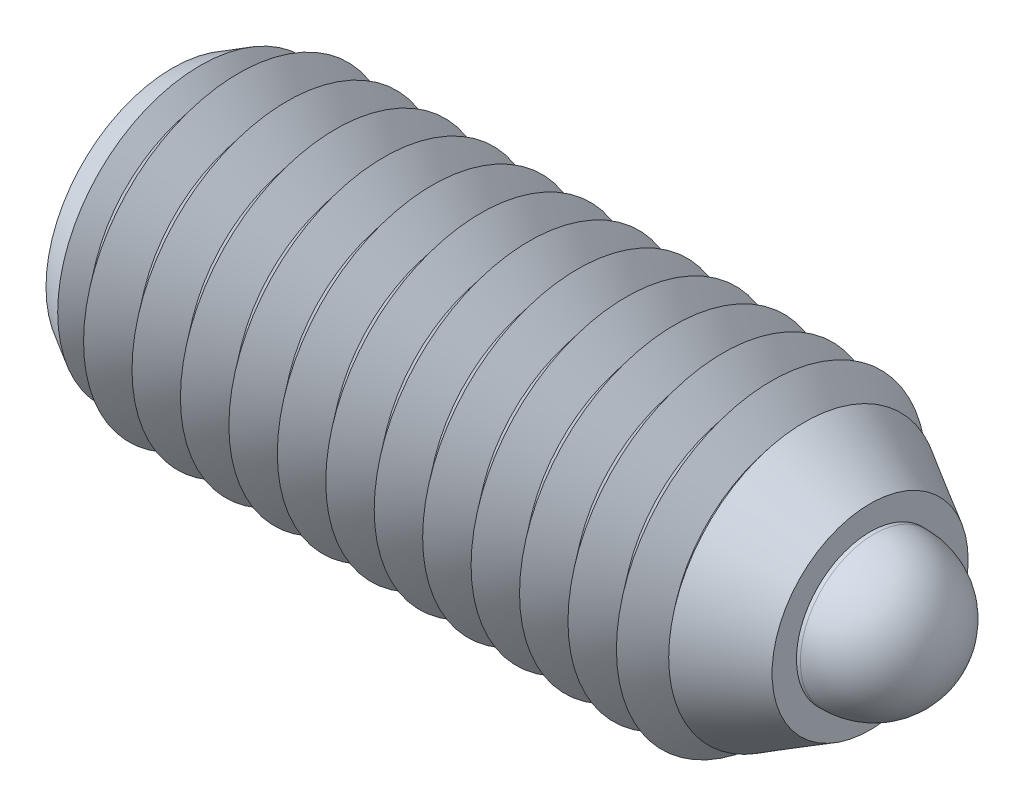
ISO-10303-21;
HEADER;
FILE_DESCRIPTION(('STEP AP214'),'2;1');
FILE_NAME('part.step','',(''),(''),'','','');
FILE_SCHEMA(('AUTOMOTIVE_DESIGN { 1 0 10303 214 1 1 1 1 }'));
ENDSEC;
DATA;
#1=APPLICATION_CONTEXT('core data for automotive mechanical design processes');
#2=APPLICATION_PROTOCOL_DEFINITION('international standard','automotive_design',2000,#1);
#3=PRODUCT_CONTEXT('',#1,'mechanical');
#4=PRODUCT('Part','Part','',(#3));
#5=PRODUCT_RELATED_PRODUCT_CATEGORY('part','',(#4));
#6=PRODUCT_DEFINITION_FORMATION('','',#4);
#7=PRODUCT_DEFINITION_CONTEXT('part definition',#1,'design');
#8=PRODUCT_DEFINITION('design','',#6,#7);
#9=PRODUCT_DEFINITION_SHAPE('','',#8);
#10=(LENGTH_UNIT() NAMED_UNIT(*) SI_UNIT(.MILLI.,.METRE.));
#11=(NAMED_UNIT(*) PLANE_ANGLE_UNIT() SI_UNIT($,.RADIAN.));
#12=(NAMED_UNIT(*) SI_UNIT($,.STERADIAN.) SOLID_ANGLE_UNIT());
#13=UNCERTAINTY_MEASURE_WITH_UNIT(LENGTH_MEASURE(1.E-05),#10,'distance_accuracy_value','');
#14=(GEOMETRIC_REPRESENTATION_CONTEXT(3) GLOBAL_UNCERTAINTY_ASSIGNED_CONTEXT((#13)) GLOBAL_UNIT_ASSIGNED_CONTEXT((#10,
#11,#12)) REPRESENTATION_CONTEXT('',''));
#15=CARTESIAN_POINT('',(0.,0.,0.));
#16=DIRECTION('',(0.,0.,1.));
#17=DIRECTION('',(1.,0.,0.));
#18=AXIS2_PLACEMENT_3D('',#15,#16,#17);
#19=CARTESIAN_POINT('',(16.55,0.,0.));
#20=DIRECTION('',(-1.,0.,0.));
#21=DIRECTION('',(0.,0.,1.));
#22=AXIS2_PLACEMENT_3D('',#19,#20,#21);
#23=CYLINDRICAL_SURFACE('',#22,2.66);
#24=CARTESIAN_POINT('',(13.67,0.,0.));
#25=DIRECTION('',(1.,0.,0.));
#26=DIRECTION('',(0.,0.,-1.));
#27=AXIS2_PLACEMENT_3D('',#24,#25,#26);
#28=CIRCLE('',#27,2.66);
#29=CARTESIAN_POINT('',(13.67,0.,-2.66));
#30=VERTEX_POINT('',#29);
#31=EDGE_CURVE('P0_E21',#30,#30,#28,.T.);
#32=ORIENTED_EDGE('',*,*,#31,.T.);
#33=EDGE_LOOP('',(#32));
#34=FACE_BOUND('',#33,.T.);
#35=CARTESIAN_POINT('',(15.79,0.,0.));
#36=DIRECTION('',(1.,0.,0.));
#37=DIRECTION('',(0.,0.,-1.));
#38=AXIS2_PLACEMENT_3D('',#35,#36,#37);
#39=CIRCLE('',#38,2.66);
#40=CARTESIAN_POINT('',(15.79,0.,-2.66));
#41=VERTEX_POINT('',#40);
#42=EDGE_CURVE('P0_E25',#41,#41,#39,.F.);
#43=ORIENTED_EDGE('',*,*,#42,.T.);
#44=EDGE_LOOP('',(#43));
#45=FACE_BOUND('',#44,.T.);
#46=ADVANCED_FACE('P0_F14',(#34,#45),#23,.T.);
#47=CARTESIAN_POINT('',(12.95,0.,0.));
#48=DIRECTION('',(1.,0.,0.));
#49=DIRECTION('',(0.,0.,-1.));
#50=AXIS2_PLACEMENT_3D('',#47,#48,#49);
#51=PLANE('',#50);
#52=CARTESIAN_POINT('',(12.95,0.,0.));
#53=DIRECTION('',(1.,0.,0.));
#54=DIRECTION('',(0.,0.,-1.));
#55=AXIS2_PLACEMENT_3D('',#52,#53,#54);
#56=CIRCLE('',#55,2.46707658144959);
#57=CARTESIAN_POINT('',(12.95,0.,-2.46707658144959));
#58=VERTEX_POINT('',#57);
#59=EDGE_CURVE('P0_E10',#58,#58,#56,.F.);
#60=ORIENTED_EDGE('',*,*,#59,.T.);
#61=EDGE_LOOP('',(#60));
#62=FACE_BOUND('',#61,.T.);
#63=ADVANCED_FACE('P0_F43',(#62),#51,.F.);
#64=CARTESIAN_POINT('',(18.1,0.,0.));
#65=DIRECTION('',(-1.,0.,0.));
#66=DIRECTION('',(0.,0.,1.));
#67=AXIS2_PLACEMENT_3D('',#64,#65,#66);
#68=CYLINDRICAL_SURFACE('',#67,1.9);
#69=CARTESIAN_POINT('',(18.1,0.,0.));
#70=DIRECTION('',(1.,0.,0.));
#71=DIRECTION('',(0.,0.,-1.));
#72=AXIS2_PLACEMENT_3D('',#69,#70,#71);
#73=CIRCLE('',#72,1.9);
#74=CARTESIAN_POINT('',(18.1,0.,1.9));
#75=VERTEX_POINT('',#74);
#76=EDGE_CURVE('P0_E29',#75,#75,#73,.T.);
#77=CARTESIAN_POINT('',(16.55,0.,0.));
#78=DIRECTION('',(1.,0.,0.));
#79=DIRECTION('',(0.,0.,-1.));
#80=AXIS2_PLACEMENT_3D('',#77,#78,#79);
#81=CIRCLE('',#80,1.9);
#82=CARTESIAN_POINT('',(16.55,0.,1.9));
#83=VERTEX_POINT('',#82);
#84=EDGE_CURVE('P0_E32',#83,#83,#81,.T.);
#85=CARTESIAN_POINT('',(18.1,0.,1.9));
#86=CARTESIAN_POINT('',(18.0838541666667,0.,1.9));
#87=CARTESIAN_POINT('',(18.0677083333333,0.,1.9));
#88=CARTESIAN_POINT('',(18.0354166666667,0.,1.9));
#89=CARTESIAN_POINT('',(18.0192708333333,0.,1.9));
#90=CARTESIAN_POINT('',(17.9869791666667,0.,1.9));
#91=CARTESIAN_POINT('',(17.9708333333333,0.,1.9));
#92=CARTESIAN_POINT('',(17.9385416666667,0.,1.9));
#93=CARTESIAN_POINT('',(17.9223958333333,0.,1.9));
#94=CARTESIAN_POINT('',(17.8901041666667,0.,1.9));
#95=CARTESIAN_POINT('',(17.8739583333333,0.,1.9));
#96=CARTESIAN_POINT('',(17.8416666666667,0.,1.9));
#97=CARTESIAN_POINT('',(17.8255208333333,0.,1.9));
#98=CARTESIAN_POINT('',(17.7932291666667,0.,1.9));
#99=CARTESIAN_POINT('',(17.7770833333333,0.,1.9));
#100=CARTESIAN_POINT('',(17.7447916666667,0.,1.9));
#101=CARTESIAN_POINT('',(17.7286458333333,0.,1.9));
#102=CARTESIAN_POINT('',(17.6963541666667,0.,1.9));
#103=CARTESIAN_POINT('',(17.6802083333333,0.,1.9));
#104=CARTESIAN_POINT('',(17.6479166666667,0.,1.9));
#105=CARTESIAN_POINT('',(17.6317708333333,0.,1.9));
#106=CARTESIAN_POINT('',(17.5994791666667,0.,1.9));
#107=CARTESIAN_POINT('',(17.5833333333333,0.,1.9));
#108=CARTESIAN_POINT('',(17.5510416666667,0.,1.9));
#109=CARTESIAN_POINT('',(17.5348958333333,0.,1.9));
#110=CARTESIAN_POINT('',(17.5026041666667,0.,1.9));
#111=CARTESIAN_POINT('',(17.4864583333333,0.,1.9));
#112=CARTESIAN_POINT('',(17.4541666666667,0.,1.9));
#113=CARTESIAN_POINT('',(17.4380208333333,0.,1.9));
#114=CARTESIAN_POINT('',(17.4057291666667,0.,1.9));
#115=CARTESIAN_POINT('',(17.3895833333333,0.,1.9));
#116=CARTESIAN_POINT('',(17.3572916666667,0.,1.9));
#117=CARTESIAN_POINT('',(17.3411458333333,0.,1.9));
#118=CARTESIAN_POINT('',(17.3088541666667,0.,1.9));
#119=CARTESIAN_POINT('',(17.2927083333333,0.,1.9));
#120=CARTESIAN_POINT('',(17.2604166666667,0.,1.9));
#121=CARTESIAN_POINT('',(17.2442708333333,0.,1.9));
#122=CARTESIAN_POINT('',(17.2119791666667,0.,1.9));
#123=CARTESIAN_POINT('',(17.1958333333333,0.,1.9));
#124=CARTESIAN_POINT('',(17.1635416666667,0.,1.9));
#125=CARTESIAN_POINT('',(17.1473958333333,0.,1.9));
#126=CARTESIAN_POINT('',(17.1151041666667,0.,1.9));
#127=CARTESIAN_POINT('',(17.0989583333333,0.,1.9));
#128=CARTESIAN_POINT('',(17.0666666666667,0.,1.9));
#129=CARTESIAN_POINT('',(17.0505208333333,0.,1.9));
#130=CARTESIAN_POINT('',(17.0182291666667,0.,1.9));
#131=CARTESIAN_POINT('',(17.0020833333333,0.,1.9));
#132=CARTESIAN_POINT('',(16.9697916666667,0.,1.9));
#133=CARTESIAN_POINT('',(16.9536458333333,0.,1.9));
#134=CARTESIAN_POINT('',(16.9213541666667,0.,1.9));
#135=CARTESIAN_POINT('',(16.9052083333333,0.,1.9));
#136=CARTESIAN_POINT('',(16.8729166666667,0.,1.9));
#137=CARTESIAN_POINT('',(16.8567708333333,0.,1.9));
#138=CARTESIAN_POINT('',(16.8244791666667,0.,1.9));
#139=CARTESIAN_POINT('',(16.8083333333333,0.,1.9));
#140=CARTESIAN_POINT('',(16.7760416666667,0.,1.9));
#141=CARTESIAN_POINT('',(16.7598958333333,0.,1.9));
#142=CARTESIAN_POINT('',(16.7276041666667,0.,1.9));
#143=CARTESIAN_POINT('',(16.7114583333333,0.,1.9));
#144=CARTESIAN_POINT('',(16.6791666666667,0.,1.9));
#145=CARTESIAN_POINT('',(16.6630208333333,0.,1.9));
#146=CARTESIAN_POINT('',(16.6307291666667,0.,1.9));
#147=CARTESIAN_POINT('',(16.6145833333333,0.,1.9));
#148=CARTESIAN_POINT('',(16.5822916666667,0.,1.9));
#149=CARTESIAN_POINT('',(16.5661458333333,0.,1.9));
#150=CARTESIAN_POINT('',(16.55,0.,1.9));
#151=B_SPLINE_CURVE_WITH_KNOTS('',3,(#85,#86,#87,#88,#89,#90,#91,#92,#93,#94,#95,#96,#97,#98,
#99,#100,#101,#102,#103,#104,#105,#106,#107,#108,#109,#110,#111,#112,#113,#114,#115,#116,#117,
#118,#119,#120,#121,#122,#123,#124,#125,#126,#127,#128,#129,#130,#131,#132,#133,#134,#135,#136,
#137,#138,#139,#140,#141,#142,#143,#144,#145,#146,#147,#148,#149,#150),.UNSPECIFIED.,.F.,.F.,(4,
2,2,2,2,2,2,2,2,2,2,2,2,2,2,2,2,2,2,2,2,2,2,2,2,2,2,2,2,2,2,2,4),(0.,0.0484374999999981,
0.0968749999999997,0.145312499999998,0.193749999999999,0.242187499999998,0.290624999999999,
0.339062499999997,0.387499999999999,0.435937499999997,0.484374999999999,0.532812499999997,
0.581249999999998,0.629687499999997,0.678124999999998,0.726562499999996,0.774999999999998,
0.823437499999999,0.871874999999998,0.920312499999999,0.968749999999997,1.0171875,1.065625,
1.1140625,1.1625,1.2109375,1.259375,1.3078125,1.35625,1.4046875,1.453125,1.5015625,1.55),.UNSPECIFIED.);
#152=EDGE_CURVE('P0_BSEAM40',#75,#83,#151,.T.);
#153=ORIENTED_EDGE('',*,*,#76,.F.);
#154=ORIENTED_EDGE('',*,*,#84,.T.);
#155=ORIENTED_EDGE('',*,*,#152,.T.);
#156=ORIENTED_EDGE('',*,*,#152,.F.);
#157=EDGE_LOOP('',(#153,#155,#154,#156));
#158=FACE_BOUND('',#157,.T.);
#159=ADVANCED_FACE('P0_F40',(#158),#68,.T.);
#160=CARTESIAN_POINT('',(18.1,0.,0.));
#161=DIRECTION('',(-1.,0.,0.));
#162=DIRECTION('',(0.,1.,0.));
#163=AXIS2_PLACEMENT_3D('',#160,#161,#162);
#164=SPHERICAL_SURFACE('',#163,1.9);
#165=ORIENTED_EDGE('',*,*,#76,.T.);
#166=EDGE_LOOP('',(#165));
#167=FACE_BOUND('',#166,.T.);
#168=ADVANCED_FACE('P0_F38',(#167),#164,.T.);
#169=CARTESIAN_POINT('',(16.55,0.,0.));
#170=DIRECTION('',(-1.,0.,0.));
#171=DIRECTION('',(0.,0.,1.));
#172=AXIS2_PLACEMENT_3D('',#169,#170,#171);
#173=CONICAL_SURFACE('',#172,1.9,0.785398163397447);
#174=ORIENTED_EDGE('',*,*,#42,.F.);
#175=EDGE_LOOP('',(#174));
#176=FACE_BOUND('',#175,.T.);
#177=ORIENTED_EDGE('',*,*,#84,.F.);
#178=EDGE_LOOP('',(#177));
#179=FACE_BOUND('',#178,.T.);
#180=ADVANCED_FACE('P0_F47',(#176,#179),#173,.T.);
#181=CARTESIAN_POINT('',(13.67,0.,0.));
#182=DIRECTION('',(1.,0.,0.));
#183=DIRECTION('',(0.,0.,-1.));
#184=AXIS2_PLACEMENT_3D('',#181,#182,#183);
#185=CONICAL_SURFACE('',#184,2.66,0.261799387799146);
#186=ORIENTED_EDGE('',*,*,#59,.F.);
#187=EDGE_LOOP('',(#186));
#188=FACE_BOUND('',#187,.T.);
#189=ORIENTED_EDGE('',*,*,#31,.F.);
#190=EDGE_LOOP('',(#189));
#191=FACE_BOUND('',#190,.T.);
#192=ADVANCED_FACE('P0_F16',(#188,#191),#185,.T.);
#193=CLOSED_SHELL('',(#46,#63,#159,#168,#180,#192));
#194=MANIFOLD_SOLID_BREP('P0_B1',#193);
#195=CARTESIAN_POINT('',(18.,0.,0.));
#196=DIRECTION('',(-1.,0.,0.));
#197=DIRECTION('',(0.,0.,1.));
#198=AXIS2_PLACEMENT_3D('',#195,#196,#197);
#199=CONICAL_SURFACE('',#198,2.53,0.523598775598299);
#200=CARTESIAN_POINT('',(18.,0.,0.));
#201=DIRECTION('',(1.,0.,0.));
#202=DIRECTION('',(0.,0.,-1.));
#203=AXIS2_PLACEMENT_3D('',#200,#201,#202);
#204=CIRCLE('',#203,2.53);
#205=CARTESIAN_POINT('',(18.,0.,-2.53));
#206=VERTEX_POINT('',#205);
#207=EDGE_CURVE('P1_E326',#206,#206,#204,.T.);
#208=ORIENTED_EDGE('',*,*,#207,.F.);
#209=EDGE_LOOP('',(#208));
#210=FACE_BOUND('',#209,.T.);
#211=CARTESIAN_POINT('',(16.3087321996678,0.,0.));
#212=DIRECTION('',(1.,0.,0.));
#213=DIRECTION('',(0.,0.,-1.));
#214=AXIS2_PLACEMENT_3D('',#211,#212,#213);
#215=CIRCLE('',#214,3.50645391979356);
#216=CARTESIAN_POINT('',(16.3087321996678,0.,-3.50645391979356));
#217=VERTEX_POINT('',#216);
#218=EDGE_CURVE('P1_E330',#217,#217,#215,.T.);
#219=ORIENTED_EDGE('',*,*,#218,.T.);
#220=EDGE_LOOP('',(#219));
#221=FACE_BOUND('',#220,.T.);
#222=ADVANCED_FACE('P1_F15',(#210,#221),#199,.T.);
#223=CARTESIAN_POINT('',(18.,0.,0.));
#224=DIRECTION('',(1.,0.,0.));
#225=DIRECTION('',(0.,0.,-1.));
#226=AXIS2_PLACEMENT_3D('',#223,#224,#225);
#227=PLANE('',#226);
#228=ORIENTED_EDGE('',*,*,#207,.T.);
#229=EDGE_LOOP('',(#228));
#230=FACE_BOUND('',#229,.T.);
#231=CARTESIAN_POINT('',(18.,0.,0.));
#232=DIRECTION('',(1.,0.,0.));
#233=DIRECTION('',(0.,0.,-1.));
#234=AXIS2_PLACEMENT_3D('',#231,#232,#233);
#235=CIRCLE('',#234,1.9);
#236=CARTESIAN_POINT('',(18.,0.,-1.9));
#237=VERTEX_POINT('',#236);
#238=EDGE_CURVE('P1_E333',#237,#237,#235,.T.);
#239=ORIENTED_EDGE('',*,*,#238,.F.);
#240=EDGE_LOOP('',(#239));
#241=FACE_BOUND('',#240,.T.);
#242=ADVANCED_FACE('P1_F188',(#230,#241),#227,.T.);
#243=CARTESIAN_POINT('',(5.4,0.,0.));
#244=DIRECTION('',(-1.,0.,0.));
#245=DIRECTION('',(0.,0.,1.));
#246=AXIS2_PLACEMENT_3D('',#243,#244,#245);
#247=PLANE('',#246);
#248=CARTESIAN_POINT('',(5.4,0.,0.));
#249=DIRECTION('',(1.,0.,0.));
#250=DIRECTION('',(0.,0.,-1.));
#251=AXIS2_PLACEMENT_3D('',#248,#249,#250);
#252=CIRCLE('',#251,2.66);
#253=CARTESIAN_POINT('',(5.4,0.,-2.66));
#254=VERTEX_POINT('',#253);
#255=EDGE_CURVE('P1_E416',#254,#254,#252,.T.);
#256=ORIENTED_EDGE('',*,*,#255,.T.);
#257=EDGE_LOOP('',(#256));
#258=FACE_BOUND('',#257,.T.);
#259=ADVANCED_FACE('P1_F194',(#258),#247,.F.);
#260=CARTESIAN_POINT('',(18.,0.,0.));
#261=DIRECTION('',(1.,0.,0.));
#262=DIRECTION('',(0.,0.,-1.));
#263=AXIS2_PLACEMENT_3D('',#260,#261,#262);
#264=CYLINDRICAL_SURFACE('',#263,2.66);
#265=ORIENTED_EDGE('',*,*,#255,.F.);
#266=EDGE_LOOP('',(#265));
#267=FACE_BOUND('',#266,.T.);
#268=CARTESIAN_POINT('',(16.2,0.,0.));
#269=DIRECTION('',(1.,0.,0.));
#270=DIRECTION('',(0.,0.,-1.));
#271=AXIS2_PLACEMENT_3D('',#268,#269,#270);
#272=CIRCLE('',#271,2.66);
#273=CARTESIAN_POINT('',(16.2,0.,-2.66));
#274=VERTEX_POINT('',#273);
#275=EDGE_CURVE('P1_E414',#274,#274,#272,.T.);
#276=ORIENTED_EDGE('',*,*,#275,.T.);
#277=EDGE_LOOP('',(#276));
#278=FACE_BOUND('',#277,.T.);
#279=ADVANCED_FACE('P1_F453',(#267,#278),#264,.F.);
#280=CARTESIAN_POINT('',(18.,0.,0.));
#281=DIRECTION('',(-1.,0.,0.));
#282=DIRECTION('',(0.,0.,1.));
#283=AXIS2_PLACEMENT_3D('',#280,#281,#282);
#284=CONICAL_SURFACE('',#283,1.9,0.399515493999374);
#285=ORIENTED_EDGE('',*,*,#275,.F.);
#286=EDGE_LOOP('',(#285));
#287=FACE_BOUND('',#286,.T.);
#288=ORIENTED_EDGE('',*,*,#238,.T.);
#289=EDGE_LOOP('',(#288));
#290=FACE_BOUND('',#289,.T.);
#291=ADVANCED_FACE('P1_F459',(#287,#290),#284,.F.);
#292=CARTESIAN_POINT('',(16.0788853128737,0.,0.));
#293=DIRECTION('',(1.,0.,0.));
#294=DIRECTION('',(0.,0.,-1.));
#295=AXIS2_PLACEMENT_3D('',#292,#293,#294);
#296=CONICAL_SURFACE('',#295,3.2193752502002,0.895664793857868);
#297=ORIENTED_EDGE('',*,*,#218,.F.);
#298=EDGE_LOOP('',(#297));
#299=FACE_BOUND('',#298,.T.);
#300=CARTESIAN_POINT('',(16.0788853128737,0.,0.));
#301=DIRECTION('',(-1.,0.,0.));
#302=DIRECTION('',(0.,0.,1.));
#303=AXIS2_PLACEMENT_3D('',#300,#301,#302);
#304=CIRCLE('',#303,3.2193752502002);
#305=CARTESIAN_POINT('',(16.0788853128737,0.,3.2193752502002));
#306=VERTEX_POINT('',#305);
#307=EDGE_CURVE('P1_E334',#306,#306,#304,.T.);
#308=ORIENTED_EDGE('',*,*,#307,.F.);
#309=EDGE_LOOP('',(#308));
#310=FACE_BOUND('',#309,.T.);
#311=ADVANCED_FACE('P1_F466',(#299,#310),#296,.T.);
#312=CARTESIAN_POINT('',(15.4538853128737,0.,0.));
#313=DIRECTION('',(-1.,0.,0.));
#314=DIRECTION('',(0.,0.,1.));
#315=AXIS2_PLACEMENT_3D('',#312,#313,#314);
#316=CONICAL_SURFACE('',#315,4.,0.895664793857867);
#317=ORIENTED_EDGE('',*,*,#307,.T.);
#318=EDGE_LOOP('',(#317));
#319=FACE_BOUND('',#318,.T.);
#320=CARTESIAN_POINT('',(15.4538853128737,0.,0.));
#321=DIRECTION('',(-1.,0.,0.));
#322=DIRECTION('',(0.,0.,1.));
#323=AXIS2_PLACEMENT_3D('',#320,#321,#322);
#324=CIRCLE('',#323,4.);
#325=CARTESIAN_POINT('',(15.4538853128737,0.,4.));
#326=VERTEX_POINT('',#325);
#327=EDGE_CURVE('P1_E407',#326,#326,#324,.T.);
#328=ORIENTED_EDGE('',*,*,#327,.F.);
#329=EDGE_LOOP('',(#328));
#330=FACE_BOUND('',#329,.T.);
#331=ADVANCED_FACE('P1_F474',(#319,#330),#316,.T.);
#332=CARTESIAN_POINT('',(14.8288853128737,0.,0.));
#333=DIRECTION('',(1.,0.,0.));
#334=DIRECTION('',(0.,0.,-1.));
#335=AXIS2_PLACEMENT_3D('',#332,#333,#334);
#336=CONICAL_SURFACE('',#335,3.2193752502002,0.895664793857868);
#337=ORIENTED_EDGE('',*,*,#327,.T.);
#338=EDGE_LOOP('',(#337));
#339=FACE_BOUND('',#338,.T.);
#340=CARTESIAN_POINT('',(14.8288853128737,0.,0.));
#341=DIRECTION('',(-1.,0.,0.));
#342=DIRECTION('',(0.,0.,1.));
#343=AXIS2_PLACEMENT_3D('',#340,#341,#342);
#344=CIRCLE('',#343,3.2193752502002);
#345=CARTESIAN_POINT('',(14.8288853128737,0.,3.2193752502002));
#346=VERTEX_POINT('',#345);
#347=EDGE_CURVE('P1_E404',#346,#346,#344,.T.);
#348=ORIENTED_EDGE('',*,*,#347,.F.);
#349=EDGE_LOOP('',(#348));
#350=FACE_BOUND('',#349,.T.);
#351=ADVANCED_FACE('P1_F482',(#339,#350),#336,.T.);
#352=CARTESIAN_POINT('',(14.2038853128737,0.,0.));
#353=DIRECTION('',(-1.,0.,0.));
#354=DIRECTION('',(0.,0.,1.));
#355=AXIS2_PLACEMENT_3D('',#352,#353,#354);
#356=CONICAL_SURFACE('',#355,4.,0.895664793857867);
#357=ORIENTED_EDGE('',*,*,#347,.T.);
#358=EDGE_LOOP('',(#357));
#359=FACE_BOUND('',#358,.T.);
#360=CARTESIAN_POINT('',(14.2038853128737,0.,0.));
#361=DIRECTION('',(-1.,0.,0.));
#362=DIRECTION('',(0.,0.,1.));
#363=AXIS2_PLACEMENT_3D('',#360,#361,#362);
#364=CIRCLE('',#363,4.);
#365=CARTESIAN_POINT('',(14.2038853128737,0.,4.));
#366=VERTEX_POINT('',#365);
#367=EDGE_CURVE('P1_E401',#366,#366,#364,.T.);
#368=ORIENTED_EDGE('',*,*,#367,.F.);
#369=EDGE_LOOP('',(#368));
#370=FACE_BOUND('',#369,.T.);
#371=ADVANCED_FACE('P1_F490',(#359,#370),#356,.T.);
#372=CARTESIAN_POINT('',(13.5788853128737,0.,0.));
#373=DIRECTION('',(1.,0.,0.));
#374=DIRECTION('',(0.,0.,-1.));
#375=AXIS2_PLACEMENT_3D('',#372,#373,#374);
#376=CONICAL_SURFACE('',#375,3.2193752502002,0.895664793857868);
#377=ORIENTED_EDGE('',*,*,#367,.T.);
#378=EDGE_LOOP('',(#377));
#379=FACE_BOUND('',#378,.T.);
#380=CARTESIAN_POINT('',(13.5788853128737,0.,0.));
#381=DIRECTION('',(-1.,0.,0.));
#382=DIRECTION('',(0.,0.,1.));
#383=AXIS2_PLACEMENT_3D('',#380,#381,#382);
#384=CIRCLE('',#383,3.2193752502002);
#385=CARTESIAN_POINT('',(13.5788853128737,0.,3.2193752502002));
#386=VERTEX_POINT('',#385);
#387=EDGE_CURVE('P1_E398',#386,#386,#384,.T.);
#388=ORIENTED_EDGE('',*,*,#387,.F.);
#389=EDGE_LOOP('',(#388));
#390=FACE_BOUND('',#389,.T.);
#391=ADVANCED_FACE('P1_F498',(#379,#390),#376,.T.);
#392=CARTESIAN_POINT('',(12.9538853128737,0.,0.));
#393=DIRECTION('',(-1.,0.,0.));
#394=DIRECTION('',(0.,0.,1.));
#395=AXIS2_PLACEMENT_3D('',#392,#393,#394);
#396=CONICAL_SURFACE('',#395,4.,0.895664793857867);
#397=ORIENTED_EDGE('',*,*,#387,.T.);
#398=EDGE_LOOP('',(#397));
#399=FACE_BOUND('',#398,.T.);
#400=CARTESIAN_POINT('',(12.9538853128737,0.,0.));
#401=DIRECTION('',(-1.,0.,0.));
#402=DIRECTION('',(0.,0.,1.));
#403=AXIS2_PLACEMENT_3D('',#400,#401,#402);
#404=CIRCLE('',#403,4.);
#405=CARTESIAN_POINT('',(12.9538853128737,0.,4.));
#406=VERTEX_POINT('',#405);
#407=EDGE_CURVE('P1_E395',#406,#406,#404,.T.);
#408=ORIENTED_EDGE('',*,*,#407,.F.);
#409=EDGE_LOOP('',(#408));
#410=FACE_BOUND('',#409,.T.);
#411=ADVANCED_FACE('P1_F506',(#399,#410),#396,.T.);
#412=CARTESIAN_POINT('',(12.3288853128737,0.,0.));
#413=DIRECTION('',(1.,0.,0.));
#414=DIRECTION('',(0.,0.,-1.));
#415=AXIS2_PLACEMENT_3D('',#412,#413,#414);
#416=CONICAL_SURFACE('',#415,3.2193752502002,0.895664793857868);
#417=ORIENTED_EDGE('',*,*,#407,.T.);
#418=EDGE_LOOP('',(#417));
#419=FACE_BOUND('',#418,.T.);
#420=CARTESIAN_POINT('',(12.3288853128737,0.,0.));
#421=DIRECTION('',(-1.,0.,0.));
#422=DIRECTION('',(0.,0.,1.));
#423=AXIS2_PLACEMENT_3D('',#420,#421,#422);
#424=CIRCLE('',#423,3.2193752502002);
#425=CARTESIAN_POINT('',(12.3288853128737,0.,3.2193752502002));
#426=VERTEX_POINT('',#425);
#427=EDGE_CURVE('P1_E392',#426,#426,#424,.T.);
#428=ORIENTED_EDGE('',*,*,#427,.F.);
#429=EDGE_LOOP('',(#428));
#430=FACE_BOUND('',#429,.T.);
#431=ADVANCED_FACE('P1_F514',(#419,#430),#416,.T.);
#432=CARTESIAN_POINT('',(11.7038853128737,0.,0.));
#433=DIRECTION('',(-1.,0.,0.));
#434=DIRECTION('',(0.,0.,1.));
#435=AXIS2_PLACEMENT_3D('',#432,#433,#434);
#436=CONICAL_SURFACE('',#435,4.,0.895664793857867);
#437=ORIENTED_EDGE('',*,*,#427,.T.);
#438=EDGE_LOOP('',(#437));
#439=FACE_BOUND('',#438,.T.);
#440=CARTESIAN_POINT('',(11.7038853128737,0.,0.));
#441=DIRECTION('',(-1.,0.,0.));
#442=DIRECTION('',(0.,0.,1.));
#443=AXIS2_PLACEMENT_3D('',#440,#441,#442);
#444=CIRCLE('',#443,4.);
#445=CARTESIAN_POINT('',(11.7038853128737,0.,4.));
#446=VERTEX_POINT('',#445);
#447=EDGE_CURVE('P1_E389',#446,#446,#444,.T.);
#448=ORIENTED_EDGE('',*,*,#447,.F.);
#449=EDGE_LOOP('',(#448));
#450=FACE_BOUND('',#449,.T.);
#451=ADVANCED_FACE('P1_F522',(#439,#450),#436,.T.);
#452=CARTESIAN_POINT('',(11.0788853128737,0.,0.));
#453=DIRECTION('',(1.,0.,0.));
#454=DIRECTION('',(0.,0.,-1.));
#455=AXIS2_PLACEMENT_3D('',#452,#453,#454);
#456=CONICAL_SURFACE('',#455,3.2193752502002,0.895664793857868);
#457=ORIENTED_EDGE('',*,*,#447,.T.);
#458=EDGE_LOOP('',(#457));
#459=FACE_BOUND('',#458,.T.);
#460=CARTESIAN_POINT('',(11.0788853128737,0.,0.));
#461=DIRECTION('',(-1.,0.,0.));
#462=DIRECTION('',(0.,0.,1.));
#463=AXIS2_PLACEMENT_3D('',#460,#461,#462);
#464=CIRCLE('',#463,3.2193752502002);
#465=CARTESIAN_POINT('',(11.0788853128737,0.,3.2193752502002));
#466=VERTEX_POINT('',#465);
#467=EDGE_CURVE('P1_E386',#466,#466,#464,.T.);
#468=ORIENTED_EDGE('',*,*,#467,.F.);
#469=EDGE_LOOP('',(#468));
#470=FACE_BOUND('',#469,.T.);
#471=ADVANCED_FACE('P1_F530',(#459,#470),#456,.T.);
#472=CARTESIAN_POINT('',(10.4538853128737,0.,0.));
#473=DIRECTION('',(-1.,0.,0.));
#474=DIRECTION('',(0.,0.,1.));
#475=AXIS2_PLACEMENT_3D('',#472,#473,#474);
#476=CONICAL_SURFACE('',#475,4.,0.895664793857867);
#477=ORIENTED_EDGE('',*,*,#467,.T.);
#478=EDGE_LOOP('',(#477));
#479=FACE_BOUND('',#478,.T.);
#480=CARTESIAN_POINT('',(10.4538853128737,0.,0.));
#481=DIRECTION('',(-1.,0.,0.));
#482=DIRECTION('',(0.,0.,1.));
#483=AXIS2_PLACEMENT_3D('',#480,#481,#482);
#484=CIRCLE('',#483,4.);
#485=CARTESIAN_POINT('',(10.4538853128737,0.,4.));
#486=VERTEX_POINT('',#485);
#487=EDGE_CURVE('P1_E383',#486,#486,#484,.T.);
#488=ORIENTED_EDGE('',*,*,#487,.F.);
#489=EDGE_LOOP('',(#488));
#490=FACE_BOUND('',#489,.T.);
#491=ADVANCED_FACE('P1_F538',(#479,#490),#476,.T.);
#492=CARTESIAN_POINT('',(9.82888531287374,0.,0.));
#493=DIRECTION('',(1.,0.,0.));
#494=DIRECTION('',(0.,0.,-1.));
#495=AXIS2_PLACEMENT_3D('',#492,#493,#494);
#496=CONICAL_SURFACE('',#495,3.2193752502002,0.895664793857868);
#497=ORIENTED_EDGE('',*,*,#487,.T.);
#498=EDGE_LOOP('',(#497));
#499=FACE_BOUND('',#498,.T.);
#500=CARTESIAN_POINT('',(9.82888531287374,0.,0.));
#501=DIRECTION('',(-1.,0.,0.));
#502=DIRECTION('',(0.,0.,1.));
#503=AXIS2_PLACEMENT_3D('',#500,#501,#502);
#504=CIRCLE('',#503,3.2193752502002);
#505=CARTESIAN_POINT('',(9.82888531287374,0.,3.2193752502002));
#506=VERTEX_POINT('',#505);
#507=EDGE_CURVE('P1_E380',#506,#506,#504,.T.);
#508=ORIENTED_EDGE('',*,*,#507,.F.);
#509=EDGE_LOOP('',(#508));
#510=FACE_BOUND('',#509,.T.);
#511=ADVANCED_FACE('P1_F546',(#499,#510),#496,.T.);
#512=CARTESIAN_POINT('',(9.20388531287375,0.,0.));
#513=DIRECTION('',(-1.,0.,0.));
#514=DIRECTION('',(0.,0.,1.));
#515=AXIS2_PLACEMENT_3D('',#512,#513,#514);
#516=CONICAL_SURFACE('',#515,4.,0.895664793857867);
#517=ORIENTED_EDGE('',*,*,#507,.T.);
#518=EDGE_LOOP('',(#517));
#519=FACE_BOUND('',#518,.T.);
#520=CARTESIAN_POINT('',(9.20388531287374,0.,0.));
#521=DIRECTION('',(-1.,0.,0.));
#522=DIRECTION('',(0.,0.,1.));
#523=AXIS2_PLACEMENT_3D('',#520,#521,#522);
#524=CIRCLE('',#523,4.);
#525=CARTESIAN_POINT('',(9.20388531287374,0.,4.));
#526=VERTEX_POINT('',#525);
#527=EDGE_CURVE('P1_E377',#526,#526,#524,.T.);
#528=ORIENTED_EDGE('',*,*,#527,.F.);
#529=EDGE_LOOP('',(#528));
#530=FACE_BOUND('',#529,.T.);
#531=ADVANCED_FACE('P1_F554',(#519,#530),#516,.T.);
#532=CARTESIAN_POINT('',(8.57888531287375,0.,0.));
#533=DIRECTION('',(1.,0.,0.));
#534=DIRECTION('',(0.,0.,-1.));
#535=AXIS2_PLACEMENT_3D('',#532,#533,#534);
#536=CONICAL_SURFACE('',#535,3.2193752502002,0.895664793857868);
#537=ORIENTED_EDGE('',*,*,#527,.T.);
#538=EDGE_LOOP('',(#537));
#539=FACE_BOUND('',#538,.T.);
#540=CARTESIAN_POINT('',(8.57888531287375,0.,0.));
#541=DIRECTION('',(-1.,0.,0.));
#542=DIRECTION('',(0.,0.,1.));
#543=AXIS2_PLACEMENT_3D('',#540,#541,#542);
#544=CIRCLE('',#543,3.2193752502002);
#545=CARTESIAN_POINT('',(8.57888531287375,0.,3.2193752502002));
#546=VERTEX_POINT('',#545);
#547=EDGE_CURVE('P1_E374',#546,#546,#544,.T.);
#548=ORIENTED_EDGE('',*,*,#547,.F.);
#549=EDGE_LOOP('',(#548));
#550=FACE_BOUND('',#549,.T.);
#551=ADVANCED_FACE('P1_F562',(#539,#550),#536,.T.);
#552=CARTESIAN_POINT('',(7.95388531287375,0.,0.));
#553=DIRECTION('',(-1.,0.,0.));
#554=DIRECTION('',(0.,0.,1.));
#555=AXIS2_PLACEMENT_3D('',#552,#553,#554);
#556=CONICAL_SURFACE('',#555,4.,0.895664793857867);
#557=ORIENTED_EDGE('',*,*,#547,.T.);
#558=EDGE_LOOP('',(#557));
#559=FACE_BOUND('',#558,.T.);
#560=CARTESIAN_POINT('',(7.95388531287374,0.,0.));
#561=DIRECTION('',(-1.,0.,0.));
#562=DIRECTION('',(0.,0.,1.));
#563=AXIS2_PLACEMENT_3D('',#560,#561,#562);
#564=CIRCLE('',#563,4.);
#565=CARTESIAN_POINT('',(7.95388531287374,0.,4.));
#566=VERTEX_POINT('',#565);
#567=EDGE_CURVE('P1_E371',#566,#566,#564,.T.);
#568=ORIENTED_EDGE('',*,*,#567,.F.);
#569=EDGE_LOOP('',(#568));
#570=FACE_BOUND('',#569,.T.);
#571=ADVANCED_FACE('P1_F570',(#559,#570),#556,.T.);
#572=CARTESIAN_POINT('',(7.32888531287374,0.,0.));
#573=DIRECTION('',(1.,0.,0.));
#574=DIRECTION('',(0.,0.,-1.));
#575=AXIS2_PLACEMENT_3D('',#572,#573,#574);
#576=CONICAL_SURFACE('',#575,3.2193752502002,0.895664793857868);
#577=ORIENTED_EDGE('',*,*,#567,.T.);
#578=EDGE_LOOP('',(#577));
#579=FACE_BOUND('',#578,.T.);
#580=CARTESIAN_POINT('',(7.32888531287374,0.,0.));
#581=DIRECTION('',(-1.,0.,0.));
#582=DIRECTION('',(0.,0.,1.));
#583=AXIS2_PLACEMENT_3D('',#580,#581,#582);
#584=CIRCLE('',#583,3.2193752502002);
#585=CARTESIAN_POINT('',(7.32888531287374,0.,3.2193752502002));
#586=VERTEX_POINT('',#585);
#587=EDGE_CURVE('P1_E368',#586,#586,#584,.T.);
#588=ORIENTED_EDGE('',*,*,#587,.F.);
#589=EDGE_LOOP('',(#588));
#590=FACE_BOUND('',#589,.T.);
#591=ADVANCED_FACE('P1_F578',(#579,#590),#576,.T.);
#592=CARTESIAN_POINT('',(6.70388531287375,0.,0.));
#593=DIRECTION('',(-1.,0.,0.));
#594=DIRECTION('',(0.,0.,1.));
#595=AXIS2_PLACEMENT_3D('',#592,#593,#594);
#596=CONICAL_SURFACE('',#595,4.,0.895664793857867);
#597=ORIENTED_EDGE('',*,*,#587,.T.);
#598=EDGE_LOOP('',(#597));
#599=FACE_BOUND('',#598,.T.);
#600=CARTESIAN_POINT('',(6.70388531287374,0.,0.));
#601=DIRECTION('',(-1.,0.,0.));
#602=DIRECTION('',(0.,0.,1.));
#603=AXIS2_PLACEMENT_3D('',#600,#601,#602);
#604=CIRCLE('',#603,4.);
#605=CARTESIAN_POINT('',(6.70388531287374,0.,4.));
#606=VERTEX_POINT('',#605);
#607=EDGE_CURVE('P1_E365',#606,#606,#604,.T.);
#608=ORIENTED_EDGE('',*,*,#607,.F.);
#609=EDGE_LOOP('',(#608));
#610=FACE_BOUND('',#609,.T.);
#611=ADVANCED_FACE('P1_F586',(#599,#610),#596,.T.);
#612=CARTESIAN_POINT('',(6.07888531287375,0.,0.));
#613=DIRECTION('',(1.,0.,0.));
#614=DIRECTION('',(0.,0.,-1.));
#615=AXIS2_PLACEMENT_3D('',#612,#613,#614);
#616=CONICAL_SURFACE('',#615,3.2193752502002,0.895664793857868);
#617=ORIENTED_EDGE('',*,*,#607,.T.);
#618=EDGE_LOOP('',(#617));
#619=FACE_BOUND('',#618,.T.);
#620=CARTESIAN_POINT('',(6.07888531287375,0.,0.));
#621=DIRECTION('',(-1.,0.,0.));
#622=DIRECTION('',(0.,0.,1.));
#623=AXIS2_PLACEMENT_3D('',#620,#621,#622);
#624=CIRCLE('',#623,3.2193752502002);
#625=CARTESIAN_POINT('',(6.07888531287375,0.,3.2193752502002));
#626=VERTEX_POINT('',#625);
#627=EDGE_CURVE('P1_E362',#626,#626,#624,.T.);
#628=ORIENTED_EDGE('',*,*,#627,.F.);
#629=EDGE_LOOP('',(#628));
#630=FACE_BOUND('',#629,.T.);
#631=ADVANCED_FACE('P1_F594',(#619,#630),#616,.T.);
#632=CARTESIAN_POINT('',(5.45388531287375,0.,0.));
#633=DIRECTION('',(-1.,0.,0.));
#634=DIRECTION('',(0.,0.,1.));
#635=AXIS2_PLACEMENT_3D('',#632,#633,#634);
#636=CONICAL_SURFACE('',#635,4.,0.895664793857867);
#637=ORIENTED_EDGE('',*,*,#627,.T.);
#638=EDGE_LOOP('',(#637));
#639=FACE_BOUND('',#638,.T.);
#640=CARTESIAN_POINT('',(5.45388531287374,0.,0.));
#641=DIRECTION('',(-1.,0.,0.));
#642=DIRECTION('',(0.,0.,1.));
#643=AXIS2_PLACEMENT_3D('',#640,#641,#642);
#644=CIRCLE('',#643,4.);
#645=CARTESIAN_POINT('',(5.45388531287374,0.,4.));
#646=VERTEX_POINT('',#645);
#647=EDGE_CURVE('P1_E359',#646,#646,#644,.T.);
#648=ORIENTED_EDGE('',*,*,#647,.F.);
#649=EDGE_LOOP('',(#648));
#650=FACE_BOUND('',#649,.T.);
#651=ADVANCED_FACE('P1_F602',(#639,#650),#636,.T.);
#652=CARTESIAN_POINT('',(4.82888531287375,0.,0.));
#653=DIRECTION('',(1.,0.,0.));
#654=DIRECTION('',(0.,0.,-1.));
#655=AXIS2_PLACEMENT_3D('',#652,#653,#654);
#656=CONICAL_SURFACE('',#655,3.2193752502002,0.895664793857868);
#657=ORIENTED_EDGE('',*,*,#647,.T.);
#658=EDGE_LOOP('',(#657));
#659=FACE_BOUND('',#658,.T.);
#660=CARTESIAN_POINT('',(4.82888531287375,0.,0.));
#661=DIRECTION('',(-1.,0.,0.));
#662=DIRECTION('',(0.,0.,1.));
#663=AXIS2_PLACEMENT_3D('',#660,#661,#662);
#664=CIRCLE('',#663,3.2193752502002);
#665=CARTESIAN_POINT('',(4.82888531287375,0.,3.2193752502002));
#666=VERTEX_POINT('',#665);
#667=EDGE_CURVE('P1_E356',#666,#666,#664,.T.);
#668=ORIENTED_EDGE('',*,*,#667,.F.);
#669=EDGE_LOOP('',(#668));
#670=FACE_BOUND('',#669,.T.);
#671=ADVANCED_FACE('P1_F610',(#659,#670),#656,.T.);
#672=CARTESIAN_POINT('',(4.20388531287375,0.,0.));
#673=DIRECTION('',(-1.,0.,0.));
#674=DIRECTION('',(0.,0.,1.));
#675=AXIS2_PLACEMENT_3D('',#672,#673,#674);
#676=CONICAL_SURFACE('',#675,4.,0.895664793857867);
#677=ORIENTED_EDGE('',*,*,#667,.T.);
#678=EDGE_LOOP('',(#677));
#679=FACE_BOUND('',#678,.T.);
#680=CARTESIAN_POINT('',(4.20388531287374,0.,0.));
#681=DIRECTION('',(-1.,0.,0.));
#682=DIRECTION('',(0.,0.,1.));
#683=AXIS2_PLACEMENT_3D('',#680,#681,#682);
#684=CIRCLE('',#683,4.);
#685=CARTESIAN_POINT('',(4.20388531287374,0.,4.));
#686=VERTEX_POINT('',#685);
#687=EDGE_CURVE('P1_E353',#686,#686,#684,.T.);
#688=ORIENTED_EDGE('',*,*,#687,.F.);
#689=EDGE_LOOP('',(#688));
#690=FACE_BOUND('',#689,.T.);
#691=ADVANCED_FACE('P1_F618',(#679,#690),#676,.T.);
#692=CARTESIAN_POINT('',(3.57888531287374,0.,0.));
#693=DIRECTION('',(1.,0.,0.));
#694=DIRECTION('',(0.,0.,-1.));
#695=AXIS2_PLACEMENT_3D('',#692,#693,#694);
#696=CONICAL_SURFACE('',#695,3.2193752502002,0.895664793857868);
#697=ORIENTED_EDGE('',*,*,#687,.T.);
#698=EDGE_LOOP('',(#697));
#699=FACE_BOUND('',#698,.T.);
#700=CARTESIAN_POINT('',(3.57888531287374,0.,0.));
#701=DIRECTION('',(-1.,0.,0.));
#702=DIRECTION('',(0.,0.,1.));
#703=AXIS2_PLACEMENT_3D('',#700,#701,#702);
#704=CIRCLE('',#703,3.2193752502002);
#705=CARTESIAN_POINT('',(3.57888531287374,0.,3.2193752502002));
#706=VERTEX_POINT('',#705);
#707=EDGE_CURVE('P1_E350',#706,#706,#704,.T.);
#708=ORIENTED_EDGE('',*,*,#707,.F.);
#709=EDGE_LOOP('',(#708));
#710=FACE_BOUND('',#709,.T.);
#711=ADVANCED_FACE('P1_F626',(#699,#710),#696,.T.);
#712=CARTESIAN_POINT('',(2.95388531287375,0.,0.));
#713=DIRECTION('',(-1.,0.,0.));
#714=DIRECTION('',(0.,0.,1.));
#715=AXIS2_PLACEMENT_3D('',#712,#713,#714);
#716=CONICAL_SURFACE('',#715,4.,0.895664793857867);
#717=ORIENTED_EDGE('',*,*,#707,.T.);
#718=EDGE_LOOP('',(#717));
#719=FACE_BOUND('',#718,.T.);
#720=CARTESIAN_POINT('',(2.95388531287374,0.,0.));
#721=DIRECTION('',(-1.,0.,0.));
#722=DIRECTION('',(0.,0.,1.));
#723=AXIS2_PLACEMENT_3D('',#720,#721,#722);
#724=CIRCLE('',#723,4.);
#725=CARTESIAN_POINT('',(2.95388531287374,0.,4.));
#726=VERTEX_POINT('',#725);
#727=EDGE_CURVE('P1_E342',#726,#726,#724,.T.);
#728=ORIENTED_EDGE('',*,*,#727,.F.);
#729=EDGE_LOOP('',(#728));
#730=FACE_BOUND('',#729,.T.);
#731=ADVANCED_FACE('P1_F634',(#719,#730),#716,.T.);
#732=CARTESIAN_POINT('',(2.32888531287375,0.,0.));
#733=DIRECTION('',(1.,0.,0.));
#734=DIRECTION('',(0.,0.,-1.));
#735=AXIS2_PLACEMENT_3D('',#732,#733,#734);
#736=CONICAL_SURFACE('',#735,3.2193752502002,0.895664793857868);
#737=ORIENTED_EDGE('',*,*,#727,.T.);
#738=EDGE_LOOP('',(#737));
#739=FACE_BOUND('',#738,.T.);
#740=CARTESIAN_POINT('',(2.32888531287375,0.,0.));
#741=DIRECTION('',(-1.,0.,0.));
#742=DIRECTION('',(0.,0.,1.));
#743=AXIS2_PLACEMENT_3D('',#740,#741,#742);
#744=CIRCLE('',#743,3.2193752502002);
#745=CARTESIAN_POINT('',(2.32888531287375,0.,3.2193752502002));
#746=VERTEX_POINT('',#745);
#747=EDGE_CURVE('P1_E338',#746,#746,#744,.T.);
#748=ORIENTED_EDGE('',*,*,#747,.F.);
#749=EDGE_LOOP('',(#748));
#750=FACE_BOUND('',#749,.T.);
#751=ADVANCED_FACE('P1_F642',(#739,#750),#736,.T.);
#752=CARTESIAN_POINT('',(1.70388531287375,0.,0.));
#753=DIRECTION('',(-1.,0.,0.));
#754=DIRECTION('',(0.,0.,1.));
#755=AXIS2_PLACEMENT_3D('',#752,#753,#754);
#756=CONICAL_SURFACE('',#755,4.,0.895664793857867);
#757=ORIENTED_EDGE('',*,*,#747,.T.);
#758=EDGE_LOOP('',(#757));
#759=FACE_BOUND('',#758,.T.);
#760=CARTESIAN_POINT('',(1.70388531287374,0.,0.));
#761=DIRECTION('',(-1.,0.,0.));
#762=DIRECTION('',(0.,0.,1.));
#763=AXIS2_PLACEMENT_3D('',#760,#761,#762);
#764=CIRCLE('',#763,4.);
#765=CARTESIAN_POINT('',(1.70388531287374,0.,4.));
#766=VERTEX_POINT('',#765);
#767=EDGE_CURVE('P1_E126',#766,#766,#764,.T.);
#768=ORIENTED_EDGE('',*,*,#767,.F.);
#769=EDGE_LOOP('',(#768));
#770=FACE_BOUND('',#769,.T.);
#771=ADVANCED_FACE('P1_F650',(#759,#770),#756,.T.);
#772=CARTESIAN_POINT('',(1.07888531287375,0.,0.));
#773=DIRECTION('',(1.,0.,0.));
#774=DIRECTION('',(0.,0.,-1.));
#775=AXIS2_PLACEMENT_3D('',#772,#773,#774);
#776=CONICAL_SURFACE('',#775,3.2193752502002,0.895664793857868);
#777=ORIENTED_EDGE('',*,*,#767,.T.);
#778=EDGE_LOOP('',(#777));
#779=FACE_BOUND('',#778,.T.);
#780=CARTESIAN_POINT('',(1.07888531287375,0.,0.));
#781=DIRECTION('',(-1.,0.,0.));
#782=DIRECTION('',(0.,0.,1.));
#783=AXIS2_PLACEMENT_3D('',#780,#781,#782);
#784=CIRCLE('',#783,3.2193752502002);
#785=CARTESIAN_POINT('',(1.07888531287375,0.,3.2193752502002));
#786=VERTEX_POINT('',#785);
#787=EDGE_CURVE('P1_E123',#786,#786,#784,.T.);
#788=ORIENTED_EDGE('',*,*,#787,.F.);
#789=EDGE_LOOP('',(#788));
#790=FACE_BOUND('',#789,.T.);
#791=ADVANCED_FACE('P1_F658',(#779,#790),#776,.T.);
#792=CARTESIAN_POINT('',(0.453885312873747,0.,0.));
#793=DIRECTION('',(-1.,0.,0.));
#794=DIRECTION('',(0.,0.,1.));
#795=AXIS2_PLACEMENT_3D('',#792,#793,#794);
#796=CONICAL_SURFACE('',#795,4.,0.895664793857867);
#797=CARTESIAN_POINT('',(0.712844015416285,0.,0.));
#798=DIRECTION('',(-1.,0.,0.));
#799=DIRECTION('',(0.,0.,1.));
#800=AXIS2_PLACEMENT_3D('',#797,#798,#799);
#801=CIRCLE('',#800,3.6765606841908);
#802=CARTESIAN_POINT('',(0.712844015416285,0.,3.6765606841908));
#803=VERTEX_POINT('',#802);
#804=EDGE_CURVE('P1_E336',#803,#803,#801,.T.);
#805=ORIENTED_EDGE('',*,*,#804,.F.);
#806=EDGE_LOOP('',(#805));
#807=FACE_BOUND('',#806,.T.);
#808=ORIENTED_EDGE('',*,*,#787,.T.);
#809=EDGE_LOOP('',(#808));
#810=FACE_BOUND('',#809,.T.);
#811=ADVANCED_FACE('P1_F145',(#807,#810),#796,.T.);
#812=CARTESIAN_POINT('',(0.,0.,0.));
#813=DIRECTION('',(1.,0.,0.));
#814=DIRECTION('',(0.,0.,-1.));
#815=AXIS2_PLACEMENT_3D('',#812,#813,#814);
#816=PLANE('',#815);
#817=CARTESIAN_POINT('',(0.,0.,0.));
#818=DIRECTION('',(1.,0.,0.));
#819=DIRECTION('',(0.,0.,-1.));
#820=AXIS2_PLACEMENT_3D('',#817,#818,#819);
#821=CIRCLE('',#820,3.26499999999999);
#822=CARTESIAN_POINT('',(0.,0.,-3.26499999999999));
#823=VERTEX_POINT('',#822);
#824=EDGE_CURVE('P1_E249',#823,#823,#821,.F.);
#825=ORIENTED_EDGE('',*,*,#824,.T.);
#826=EDGE_LOOP('',(#825));
#827=FACE_BOUND('',#826,.T.);
#828=CARTESIAN_POINT('',(0.,0.,0.));
#829=DIRECTION('',(1.,0.,0.));
#830=DIRECTION('',(0.,0.,-1.));
#831=AXIS2_PLACEMENT_3D('',#828,#829,#830);
#832=CIRCLE('',#831,2.3094010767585);
#833=CARTESIAN_POINT('',(0.,-1.15470053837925,-2.));
#834=VERTEX_POINT('',#833);
#835=CARTESIAN_POINT('',(0.,1.15470053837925,-2.));
#836=VERTEX_POINT('',#835);
#837=EDGE_CURVE('P1_E19',#834,#836,#832,.T.);
#838=ORIENTED_EDGE('',*,*,#837,.T.);
#839=CARTESIAN_POINT('',(0.,2.3094010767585,0.));
#840=VERTEX_POINT('',#839);
#841=EDGE_CURVE('P1_E10',#836,#840,#832,.T.);
#842=ORIENTED_EDGE('',*,*,#841,.T.);
#843=CARTESIAN_POINT('',(0.,0.,0.));
#844=DIRECTION('',(-1.,0.,0.));
#845=DIRECTION('',(0.,0.,1.));
#846=AXIS2_PLACEMENT_3D('',#843,#844,#845);
#847=CIRCLE('',#846,2.3094010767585);
#848=CARTESIAN_POINT('',(0.,1.15470053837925,2.));
#849=VERTEX_POINT('',#848);
#850=EDGE_CURVE('P1_E35',#849,#840,#847,.T.);
#851=ORIENTED_EDGE('',*,*,#850,.F.);
#852=CARTESIAN_POINT('',(0.,-1.15470053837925,2.));
#853=VERTEX_POINT('',#852);
#854=EDGE_CURVE('P1_E24',#849,#853,#832,.T.);
#855=ORIENTED_EDGE('',*,*,#854,.T.);
#856=CARTESIAN_POINT('',(0.,-2.3094010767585,0.));
#857=VERTEX_POINT('',#856);
#858=EDGE_CURVE('P1_E250',#853,#857,#832,.T.);
#859=ORIENTED_EDGE('',*,*,#858,.T.);
#860=EDGE_CURVE('P1_E245',#857,#834,#832,.T.);
#861=ORIENTED_EDGE('',*,*,#860,.T.);
#862=EDGE_LOOP('',(#838,#842,#851,#855,#859,#861));
#863=FACE_BOUND('',#862,.T.);
#864=ADVANCED_FACE('P1_F103',(#827,#863),#816,.F.);
#865=CARTESIAN_POINT('',(1.27305734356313,0.,0.));
#866=DIRECTION('',(1.,0.,0.));
#867=DIRECTION('',(0.,0.,-1.));
#868=AXIS2_PLACEMENT_3D('',#865,#866,#867);
#869=CONICAL_SURFACE('',#868,4.,0.523598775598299);
#870=ORIENTED_EDGE('',*,*,#824,.F.);
#871=EDGE_LOOP('',(#870));
#872=FACE_BOUND('',#871,.T.);
#873=ORIENTED_EDGE('',*,*,#804,.T.);
#874=EDGE_LOOP('',(#873));
#875=FACE_BOUND('',#874,.T.);
#876=ADVANCED_FACE('P1_F17',(#872,#875),#869,.T.);
#877=CARTESIAN_POINT('',(0.,0.,0.));
#878=DIRECTION('',(-1.,0.,0.));
#879=DIRECTION('',(0.,0.,1.));
#880=AXIS2_PLACEMENT_3D('',#877,#878,#879);
#881=CONICAL_SURFACE('',#880,2.3094010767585,1.0471975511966);
#882=ORIENTED_EDGE('',*,*,#837,.F.);
#883=CARTESIAN_POINT('',(-0.74367057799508,-2.99029024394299,-2.));
#884=CARTESIAN_POINT('',(-0.702235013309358,-2.90392335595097,-2.));
#885=CARTESIAN_POINT('',(-0.661229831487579,-2.81734606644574,-2.));
#886=CARTESIAN_POINT('',(-0.580324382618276,-2.64365854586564,-2.));
#887=CARTESIAN_POINT('',(-0.540424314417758,-2.5565482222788,-2.));
#888=CARTESIAN_POINT('',(-0.461750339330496,-2.381183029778,-2.));
#889=CARTESIAN_POINT('',(-0.422984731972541,-2.29292442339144,-2.));
#890=CARTESIAN_POINT('',(-0.347191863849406,-2.11566660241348,-2.));
#891=CARTESIAN_POINT('',(-0.310164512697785,-2.02666742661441,-2.));
#892=CARTESIAN_POINT('',(-0.237368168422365,-1.84544249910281,-2.));
#893=CARTESIAN_POINT('',(-0.201657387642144,-1.7531932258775,-2.));
#894=CARTESIAN_POINT('',(-0.133204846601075,-1.56757885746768,-2.));
#895=CARTESIAN_POINT('',(-0.10046343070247,-1.47421363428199,-2.));
#896=CARTESIAN_POINT('',(-0.0388859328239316,-1.28643446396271,-2.));
#897=CARTESIAN_POINT('',(-0.0100408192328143,-1.19202351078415,-2.));
#898=CARTESIAN_POINT('',(0.0427576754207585,-1.00184859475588,-2.));
#899=CARTESIAN_POINT('',(0.0667122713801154,-0.9060849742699,-2.));
#900=CARTESIAN_POINT('',(0.108452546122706,-0.713403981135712,-2.));
#901=CARTESIAN_POINT('',(0.12625089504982,-0.616489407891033,-2.));
#902=CARTESIAN_POINT('',(0.154514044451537,-0.421576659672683,-2.));
#903=CARTESIAN_POINT('',(0.16497934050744,-0.323578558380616,-2.));
#904=CARTESIAN_POINT('',(0.177602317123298,-0.128212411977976,-2.));
#905=CARTESIAN_POINT('',(0.179858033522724,-0.0308508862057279,-2.));
#906=CARTESIAN_POINT('',(0.176133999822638,0.163710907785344,-2.));
#907=CARTESIAN_POINT('',(0.170153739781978,0.260911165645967,-2.));
#908=CARTESIAN_POINT('',(0.145763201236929,0.500738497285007,-2.));
#909=CARTESIAN_POINT('',(0.122782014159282,0.642900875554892,-2.));
#910=CARTESIAN_POINT('',(0.0635202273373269,0.924461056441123,-2.));
#911=CARTESIAN_POINT('',(0.0272235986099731,1.06385531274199,-2.));
#912=CARTESIAN_POINT('',(-0.034779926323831,1.27233476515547,-2.));
#913=CARTESIAN_POINT('',(-0.0569967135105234,1.34249760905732,-2.));
#914=CARTESIAN_POINT('',(-0.103485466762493,1.48209294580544,-2.));
#915=CARTESIAN_POINT('',(-0.12775615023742,1.55152586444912,-2.));
#916=CARTESIAN_POINT('',(-0.178000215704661,1.68975413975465,-2.));
#917=CARTESIAN_POINT('',(-0.203973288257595,1.75854960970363,-2.));
#918=CARTESIAN_POINT('',(-0.257341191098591,1.89559846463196,-2.));
#919=CARTESIAN_POINT('',(-0.284736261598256,1.96385175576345,-2.));
#920=CARTESIAN_POINT('',(-0.356418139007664,2.13807099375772,-2.));
#921=CARTESIAN_POINT('',(-0.401550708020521,2.24368858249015,-2.));
#922=CARTESIAN_POINT('',(-0.493991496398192,2.45396999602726,-2.));
#923=CARTESIAN_POINT('',(-0.541299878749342,2.55863374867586,-2.));
#924=CARTESIAN_POINT('',(-0.68572174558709,2.87151206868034,-2.));
#925=CARTESIAN_POINT('',(-0.785317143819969,3.07857874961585,-2.));
#926=CARTESIAN_POINT('',(-0.988684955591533,3.49094307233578,-2.));
#927=CARTESIAN_POINT('',(-1.09246235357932,3.6962382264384,-2.));
#928=CARTESIAN_POINT('',(-1.30268560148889,4.10542196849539,-2.));
#929=CARTESIAN_POINT('',(-1.40913111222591,4.30931073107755,-2.));
#930=CARTESIAN_POINT('',(-1.61372651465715,4.69691639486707,-2.));
#931=CARTESIAN_POINT('',(-1.71171110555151,4.88072085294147,-2.));
#932=CARTESIAN_POINT('',(-1.90879672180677,5.24773852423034,-2.));
#933=CARTESIAN_POINT('',(-2.00789778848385,5.43095171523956,-2.));
#934=CARTESIAN_POINT('',(-2.2066832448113,5.79645714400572,-2.));
#935=CARTESIAN_POINT('',(-2.3063655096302,5.97875053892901,-2.));
#936=CARTESIAN_POINT('',(-2.50637882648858,6.34296877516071,-2.));
#937=CARTESIAN_POINT('',(-2.60670984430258,6.52489363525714,-2.));
#938=CARTESIAN_POINT('',(-2.70727876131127,6.70668608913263,-2.));
#939=B_SPLINE_CURVE_WITH_KNOTS('',3,(#883,#884,#885,#886,#887,#888,#889,#890,#891,#892,#893,
#894,#895,#896,#897,#898,#899,#900,#901,#902,#903,#904,#905,#906,#907,#908,#909,#910,#911,#912,
#913,#914,#915,#916,#917,#918,#919,#920,#921,#922,#923,#924,#925,#926,#927,#928,#929,#930,#931,
#932,#933,#934,#935,#936,#937,#938),.UNSPECIFIED.,.F.,.F.,(4,2,2,2,2,2,2,2,2,2,2,2,2,2,2,2,2,2,
2,2,2,2,2,2,2,2,2,4),(0.,0.287380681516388,0.574812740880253,0.863988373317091,1.15314895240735,
1.44986982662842,1.74662506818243,2.04268017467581,2.33866164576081,2.63403028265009,
2.92937895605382,3.22118889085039,3.51301689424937,3.9441541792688,4.37581217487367,
4.59657665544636,4.81720427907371,5.03779191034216,5.25841692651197,5.60295100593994,
5.9475109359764,6.63674460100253,7.3268255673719,8.01681924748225,8.64168729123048,
9.26657853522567,9.88988035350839,10.5131495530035),.UNSPECIFIED.);
#940=EDGE_CURVE('P1_E93',#836,#834,#939,.F.);
#941=ORIENTED_EDGE('',*,*,#940,.F.);
#942=EDGE_LOOP('',(#882,#941));
#943=FACE_BOUND('',#942,.T.);
#944=ADVANCED_FACE('P1_F248',(#943),#881,.F.);
#945=ORIENTED_EDGE('',*,*,#860,.F.);
#946=CARTESIAN_POINT('',(-6.66716664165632E-05,-1.15458506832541,-2.0002));
#947=CARTESIAN_POINT('',(0.0292432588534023,-1.20532911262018,-1.91230873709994));
#948=CARTESIAN_POINT('',(0.0558999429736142,-1.2565111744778,-1.82365880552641));
#949=CARTESIAN_POINT('',(0.10243030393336,-1.35976164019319,-1.6448237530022));
#950=CARTESIAN_POINT('',(0.122287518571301,-1.41183187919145,-1.55463545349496));
#951=CARTESIAN_POINT('',(0.153199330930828,-1.51532701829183,-1.37537661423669));
#952=CARTESIAN_POINT('',(0.16445964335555,-1.56673599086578,-1.2863336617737));
#953=CARTESIAN_POINT('',(0.177904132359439,-1.66979593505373,-1.10782860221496));
#954=CARTESIAN_POINT('',(0.180099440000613,-1.72144653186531,-1.01836714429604));
#955=CARTESIAN_POINT('',(0.175541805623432,-1.81796535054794,-0.851191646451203));
#956=CARTESIAN_POINT('',(0.169907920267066,-1.86284799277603,-0.773452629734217));
#957=CARTESIAN_POINT('',(0.152048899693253,-1.95232085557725,-0.618481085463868));
#958=CARTESIAN_POINT('',(0.139817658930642,-1.99691076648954,-0.541249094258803));
#959=CARTESIAN_POINT('',(0.109239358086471,-2.08656822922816,-0.3859578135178));
#960=CARTESIAN_POINT('',(0.090762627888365,-2.13162442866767,-0.307918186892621));
#961=CARTESIAN_POINT('',(0.0488272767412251,-2.221064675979,-0.153003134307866));
#962=CARTESIAN_POINT('',(0.0253785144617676,-2.26544987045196,-0.0761257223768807));
#963=CARTESIAN_POINT('',(-6.66716664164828E-05,-2.30951654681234,0.000199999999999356));
#964=B_SPLINE_CURVE_WITH_KNOTS('',3,(#946,#947,#948,#949,#950,#951,#952,#953,#954,#955,#956,
#957,#958,#959,#960,#961,#962,#963),.UNSPECIFIED.,.F.,.F.,(4,2,2,2,2,2,2,2,4),(0.,
0.31703182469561,0.634825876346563,0.944753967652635,1.25430138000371,1.52387047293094,
1.79368946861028,2.06949491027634,2.34475850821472),.UNSPECIFIED.);
#965=EDGE_CURVE('P1_E163',#834,#857,#964,.T.);
#966=ORIENTED_EDGE('',*,*,#965,.F.);
#967=EDGE_LOOP('',(#945,#966));
#968=FACE_BOUND('',#967,.T.);
#969=ADVANCED_FACE('P1_F244',(#968),#881,.F.);
#970=ORIENTED_EDGE('',*,*,#858,.F.);
#971=CARTESIAN_POINT('',(-6.66716664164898E-05,-2.30951654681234,-0.000200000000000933));
#972=CARTESIAN_POINT('',(0.0292432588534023,-2.25877250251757,0.0876912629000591));
#973=CARTESIAN_POINT('',(0.0558999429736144,-2.20759044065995,0.17634119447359));
#974=CARTESIAN_POINT('',(0.10243030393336,-2.10433997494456,0.355176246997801));
#975=CARTESIAN_POINT('',(0.122287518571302,-2.0522697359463,0.445364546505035));
#976=CARTESIAN_POINT('',(0.153199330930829,-1.94877459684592,0.624623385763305));
#977=CARTESIAN_POINT('',(0.16445964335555,-1.89736562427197,0.713666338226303));
#978=CARTESIAN_POINT('',(0.177904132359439,-1.79430568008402,0.892171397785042));
#979=CARTESIAN_POINT('',(0.180099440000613,-1.74265508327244,0.981632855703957));
#980=CARTESIAN_POINT('',(0.175541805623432,-1.64613626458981,1.1488083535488));
#981=CARTESIAN_POINT('',(0.169907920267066,-1.60125362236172,1.22654737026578));
#982=CARTESIAN_POINT('',(0.152048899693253,-1.51178075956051,1.38151891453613));
#983=CARTESIAN_POINT('',(0.139817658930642,-1.46719084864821,1.4587509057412));
#984=CARTESIAN_POINT('',(0.109239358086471,-1.37753338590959,1.6140421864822));
#985=CARTESIAN_POINT('',(0.0907626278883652,-1.33247718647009,1.69208181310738));
#986=CARTESIAN_POINT('',(0.0488272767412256,-1.24303693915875,1.84699686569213));
#987=CARTESIAN_POINT('',(0.0253785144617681,-1.1986517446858,1.92387427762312));
#988=CARTESIAN_POINT('',(-6.66716664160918E-05,-1.15458506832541,2.0002));
#989=B_SPLINE_CURVE_WITH_KNOTS('',3,(#971,#972,#973,#974,#975,#976,#977,#978,#979,#980,#981,
#982,#983,#984,#985,#986,#987,#988),.UNSPECIFIED.,.F.,.F.,(4,2,2,2,2,2,2,2,4),(0.,
0.31703182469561,0.634825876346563,0.944753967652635,1.25430138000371,1.52387047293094,
1.79368946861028,2.06949491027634,2.34475850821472),.UNSPECIFIED.);
#990=EDGE_CURVE('P1_E156',#857,#853,#989,.T.);
#991=ORIENTED_EDGE('',*,*,#990,.F.);
#992=EDGE_LOOP('',(#970,#991));
#993=FACE_BOUND('',#992,.T.);
#994=ADVANCED_FACE('P1_F252',(#993),#881,.F.);
#995=ORIENTED_EDGE('',*,*,#854,.F.);
#996=CARTESIAN_POINT('',(-0.743670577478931,-2.99029024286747,2.));
#997=CARTESIAN_POINT('',(-0.702235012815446,-2.90392335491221,2.));
#998=CARTESIAN_POINT('',(-0.66122983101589,-2.81734606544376,2.));
#999=CARTESIAN_POINT('',(-0.580324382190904,-2.64365854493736,2.));
#1000=CARTESIAN_POINT('',(-0.540424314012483,-2.55654822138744,2.));
#1001=CARTESIAN_POINT('',(-0.461750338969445,-2.38118302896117,2.));
#1002=CARTESIAN_POINT('',(-0.422984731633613,-2.29292442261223,2.));
#1003=CARTESIAN_POINT('',(-0.34719186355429,-2.11566660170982,2.));
#1004=CARTESIAN_POINT('',(-0.310164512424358,-2.02666742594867,2.));
#1005=CARTESIAN_POINT('',(-0.237368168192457,-1.84544249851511,2.));
#1006=CARTESIAN_POINT('',(-0.201657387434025,-1.75319322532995,2.));
#1007=CARTESIAN_POINT('',(-0.133204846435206,-1.56757885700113,2.));
#1008=CARTESIAN_POINT('',(-0.10046343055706,-1.4742136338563,2.));
#1009=CARTESIAN_POINT('',(-0.0388859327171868,-1.28643446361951,2.));
#1010=CARTESIAN_POINT('',(-0.0100408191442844,-1.19202351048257,2.));
#1011=CARTESIAN_POINT('',(0.0427576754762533,-1.00184859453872,2.));
#1012=CARTESIAN_POINT('',(0.0667122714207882,-0.906084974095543,2.));
#1013=CARTESIAN_POINT('',(0.108452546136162,-0.713403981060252,2.));
#1014=CARTESIAN_POINT('',(0.126250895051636,-0.616489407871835,2.));
#1015=CARTESIAN_POINT('',(0.154514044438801,-0.421576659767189,2.));
#1016=CARTESIAN_POINT('',(0.164979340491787,-0.323578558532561,2.));
#1017=CARTESIAN_POINT('',(0.177602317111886,-0.128212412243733,2.));
#1018=CARTESIAN_POINT('',(0.179858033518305,-0.0308508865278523,2.));
#1019=CARTESIAN_POINT('',(0.176133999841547,0.163710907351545,2.));
#1020=CARTESIAN_POINT('',(0.170153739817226,0.260911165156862,2.));
#1021=CARTESIAN_POINT('',(0.145763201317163,0.500738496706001,2.));
#1022=CARTESIAN_POINT('',(0.122782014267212,0.642900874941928,2.));
#1023=CARTESIAN_POINT('',(0.063520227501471,0.924461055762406,2.));
#1024=CARTESIAN_POINT('',(0.0272235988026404,1.06385531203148,2.));
#1025=CARTESIAN_POINT('',(-0.0347799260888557,1.27233476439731,2.));
#1026=CARTESIAN_POINT('',(-0.0569967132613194,1.34249760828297,2.));
#1027=CARTESIAN_POINT('',(-0.103485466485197,1.48209294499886,2.));
#1028=CARTESIAN_POINT('',(-0.127756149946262,1.5515258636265,2.));
#1029=CARTESIAN_POINT('',(-0.178000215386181,1.68975413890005,2.));
#1030=CARTESIAN_POINT('',(-0.203973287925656,1.75854960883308,2.));
#1031=CARTESIAN_POINT('',(-0.25734119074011,1.89559846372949,2.));
#1032=CARTESIAN_POINT('',(-0.284736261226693,1.96385175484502,2.));
#1033=CARTESIAN_POINT('',(-0.356418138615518,2.1380709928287,2.));
#1034=CARTESIAN_POINT('',(-0.401550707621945,2.24368858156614,2.));
#1035=CARTESIAN_POINT('',(-0.493991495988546,2.45396999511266,2.));
#1036=CARTESIAN_POINT('',(-0.541299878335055,2.55863374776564,2.));
#1037=CARTESIAN_POINT('',(-0.685721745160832,2.87151206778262,2.));
#1038=CARTESIAN_POINT('',(-0.785317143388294,3.0785787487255,2.));
#1039=CARTESIAN_POINT('',(-0.988684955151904,3.49094307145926,2.));
#1040=CARTESIAN_POINT('',(-1.09246235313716,3.69623822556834,2.));
#1041=CARTESIAN_POINT('',(-1.30268560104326,4.10542196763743,2.));
#1042=CARTESIAN_POINT('',(-1.40913111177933,4.30931073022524,2.));
#1043=CARTESIAN_POINT('',(-1.61372651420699,4.69691639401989,2.));
#1044=CARTESIAN_POINT('',(-1.71171110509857,4.88072085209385,2.));
#1045=CARTESIAN_POINT('',(-1.90879672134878,5.2477385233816,2.));
#1046=CARTESIAN_POINT('',(-2.00789778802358,5.43095171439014,2.));
#1047=CARTESIAN_POINT('',(-2.20668324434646,5.79645714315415,2.));
#1048=CARTESIAN_POINT('',(-2.30636550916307,5.97875053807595,2.));
#1049=CARTESIAN_POINT('',(-2.50637882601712,6.34296877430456,2.));
#1050=CARTESIAN_POINT('',(-2.60670984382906,6.52489363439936,2.));
#1051=CARTESIAN_POINT('',(-2.70727876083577,6.7066860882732,2.));
#1052=B_SPLINE_CURVE_WITH_KNOTS('',3,(#996,#997,#998,#999,#1000,#1001,#1002,#1003,#1004,#1005,
#1006,#1007,#1008,#1009,#1010,#1011,#1012,#1013,#1014,#1015,#1016,#1017,#1018,#1019,#1020,#1021,
#1022,#1023,#1024,#1025,#1026,#1027,#1028,#1029,#1030,#1031,#1032,#1033,#1034,#1035,#1036,#1037,
#1038,#1039,#1040,#1041,#1042,#1043,#1044,#1045,#1046,#1047,#1048,#1049,#1050,#1051),
.UNSPECIFIED.,.F.,.F.,(4,2,2,2,2,2,2,2,2,2,2,2,2,2,2,2,2,2,2,2,2,2,2,2,2,2,2,4),(0.,
0.287380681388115,0.574812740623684,0.86398837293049,1.15314895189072,1.4498698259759,
1.74662506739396,2.04268017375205,2.33866164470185,2.63403028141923,2.92937895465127,
3.2211888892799,3.51301689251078,3.94415417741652,4.37581217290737,4.59657665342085,
4.81720427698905,5.03779190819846,5.25841692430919,5.60295100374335,5.94751093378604,
6.63674459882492,7.32682556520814,8.01681924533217,8.64168728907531,9.26657853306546,
9.889880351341,10.5131495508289),.UNSPECIFIED.);
#1053=EDGE_CURVE('P1_E100',#853,#849,#1052,.T.);
#1054=ORIENTED_EDGE('',*,*,#1053,.F.);
#1055=EDGE_LOOP('',(#995,#1054));
#1056=FACE_BOUND('',#1055,.T.);
#1057=ADVANCED_FACE('P1_F144',(#1056),#881,.F.);
#1058=ORIENTED_EDGE('',*,*,#850,.T.);
#1059=CARTESIAN_POINT('',(-6.6671666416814E-05,1.15458506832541,2.0002));
#1060=CARTESIAN_POINT('',(0.0292432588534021,1.20532911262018,1.91230873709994));
#1061=CARTESIAN_POINT('',(0.0558999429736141,1.2565111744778,1.82365880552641));
#1062=CARTESIAN_POINT('',(0.10243030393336,1.35976164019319,1.6448237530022));
#1063=CARTESIAN_POINT('',(0.122287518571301,1.41183187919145,1.55463545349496));
#1064=CARTESIAN_POINT('',(0.153199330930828,1.51532701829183,1.37537661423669));
#1065=CARTESIAN_POINT('',(0.164459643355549,1.56673599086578,1.2863336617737));
#1066=CARTESIAN_POINT('',(0.177904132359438,1.66979593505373,1.10782860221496));
#1067=CARTESIAN_POINT('',(0.180099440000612,1.72144653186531,1.01836714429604));
#1068=CARTESIAN_POINT('',(0.175541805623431,1.81796535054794,0.851191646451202));
#1069=CARTESIAN_POINT('',(0.169907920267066,1.86284799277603,0.773452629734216));
#1070=CARTESIAN_POINT('',(0.152048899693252,1.95232085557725,0.618481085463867));
#1071=CARTESIAN_POINT('',(0.139817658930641,1.99691076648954,0.541249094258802));
#1072=CARTESIAN_POINT('',(0.109239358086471,2.08656822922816,0.3859578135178));
#1073=CARTESIAN_POINT('',(0.0907626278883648,2.13162442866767,0.307918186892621));
#1074=CARTESIAN_POINT('',(0.0488272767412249,2.221064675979,0.153003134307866));
#1075=CARTESIAN_POINT('',(0.0253785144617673,2.26544987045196,0.0761257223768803));
#1076=CARTESIAN_POINT('',(-6.66716664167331E-05,2.30951654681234,-0.000199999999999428));
#1077=B_SPLINE_CURVE_WITH_KNOTS('',3,(#1059,#1060,#1061,#1062,#1063,#1064,#1065,#1066,#1067,
#1068,#1069,#1070,#1071,#1072,#1073,#1074,#1075,#1076),.UNSPECIFIED.,.F.,.F.,(4,2,2,2,2,2,2,2,
4),(0.,0.31703182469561,0.634825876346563,0.944753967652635,1.25430138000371,1.52387047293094,
1.79368946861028,2.06949491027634,2.34475850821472),.UNSPECIFIED.);
#1078=EDGE_CURVE('P1_E92',#849,#840,#1077,.T.);
#1079=ORIENTED_EDGE('',*,*,#1078,.F.);
#1080=EDGE_LOOP('',(#1058,#1079));
#1081=FACE_BOUND('',#1080,.T.);
#1082=ADVANCED_FACE('P1_F97',(#1081),#881,.F.);
#1083=ORIENTED_EDGE('',*,*,#841,.F.);
#1084=CARTESIAN_POINT('',(-6.66716664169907E-05,2.30951654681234,0.00020000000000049));
#1085=CARTESIAN_POINT('',(0.029243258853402,2.25877250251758,-0.0876912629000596));
#1086=CARTESIAN_POINT('',(0.0558999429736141,2.20759044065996,-0.176341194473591));
#1087=CARTESIAN_POINT('',(0.10243030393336,2.10433997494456,-0.355176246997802));
#1088=CARTESIAN_POINT('',(0.122287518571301,2.0522697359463,-0.445364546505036));
#1089=CARTESIAN_POINT('',(0.153199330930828,1.94877459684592,-0.624623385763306));
#1090=CARTESIAN_POINT('',(0.164459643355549,1.89736562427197,-0.713666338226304));
#1091=CARTESIAN_POINT('',(0.177904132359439,1.79430568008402,-0.892171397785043));
#1092=CARTESIAN_POINT('',(0.180099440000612,1.74265508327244,-0.981632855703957));
#1093=CARTESIAN_POINT('',(0.175541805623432,1.64613626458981,-1.1488083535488));
#1094=CARTESIAN_POINT('',(0.169907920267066,1.60125362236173,-1.22654737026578));
#1095=CARTESIAN_POINT('',(0.152048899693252,1.51178075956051,-1.38151891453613));
#1096=CARTESIAN_POINT('',(0.139817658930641,1.46719084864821,-1.4587509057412));
#1097=CARTESIAN_POINT('',(0.109239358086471,1.37753338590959,-1.6140421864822));
#1098=CARTESIAN_POINT('',(0.0907626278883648,1.33247718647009,-1.69208181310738));
#1099=CARTESIAN_POINT('',(0.0488272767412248,1.24303693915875,-1.84699686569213));
#1100=CARTESIAN_POINT('',(0.0253785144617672,1.1986517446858,-1.92387427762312));
#1101=CARTESIAN_POINT('',(-6.66716664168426E-05,1.15458506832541,-2.0002));
#1102=B_SPLINE_CURVE_WITH_KNOTS('',3,(#1084,#1085,#1086,#1087,#1088,#1089,#1090,#1091,#1092,
#1093,#1094,#1095,#1096,#1097,#1098,#1099,#1100,#1101),.UNSPECIFIED.,.F.,.F.,(4,2,2,2,2,2,2,2,
4),(0.,0.31703182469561,0.634825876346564,0.944753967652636,1.25430138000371,1.52387047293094,
1.79368946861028,2.06949491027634,2.34475850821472),.UNSPECIFIED.);
#1103=EDGE_CURVE('P1_E87',#840,#836,#1102,.T.);
#1104=ORIENTED_EDGE('',*,*,#1103,.F.);
#1105=EDGE_LOOP('',(#1083,#1104));
#1106=FACE_BOUND('',#1105,.T.);
#1107=ADVANCED_FACE('P1_F88',(#1106),#881,.F.);
#1108=CARTESIAN_POINT('',(3.24,0.,0.));
#1109=DIRECTION('',(-1.,0.,0.));
#1110=DIRECTION('',(0.,0.,1.));
#1111=AXIS2_PLACEMENT_3D('',#1108,#1109,#1110);
#1112=CONICAL_SURFACE('',#1111,2.,1.0471975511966);
#1113=CARTESIAN_POINT('',(4.39470053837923,0.,0.));
#1114=VERTEX_POINT('',#1113);
#1115=VERTEX_LOOP('',#1114);
#1116=FACE_BOUND('',#1115,.T.);
#1117=CARTESIAN_POINT('',(3.24,0.,0.));
#1118=DIRECTION('',(-1.,0.,0.));
#1119=DIRECTION('',(0.,0.,1.));
#1120=AXIS2_PLACEMENT_3D('',#1117,#1118,#1119);
#1121=CIRCLE('',#1120,2.);
#1122=CARTESIAN_POINT('',(3.24,0.,2.));
#1123=VERTEX_POINT('',#1122);
#1124=CARTESIAN_POINT('',(3.24,1.73205080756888,0.999999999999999));
#1125=VERTEX_POINT('',#1124);
#1126=EDGE_CURVE('P1_E300',#1123,#1125,#1121,.T.);
#1127=ORIENTED_EDGE('',*,*,#1126,.T.);
#1128=CARTESIAN_POINT('',(3.24,1.73205080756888,-1.));
#1129=VERTEX_POINT('',#1128);
#1130=EDGE_CURVE('P1_E329',#1125,#1129,#1121,.T.);
#1131=ORIENTED_EDGE('',*,*,#1130,.T.);
#1132=CARTESIAN_POINT('',(3.24,0.,-2.));
#1133=VERTEX_POINT('',#1132);
#1134=EDGE_CURVE('P1_E421',#1129,#1133,#1121,.T.);
#1135=ORIENTED_EDGE('',*,*,#1134,.T.);
#1136=CARTESIAN_POINT('',(3.24,-1.73205080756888,-1.));
#1137=VERTEX_POINT('',#1136);
#1138=EDGE_CURVE('P1_E423',#1133,#1137,#1121,.T.);
#1139=ORIENTED_EDGE('',*,*,#1138,.T.);
#1140=CARTESIAN_POINT('',(3.24,-1.73205080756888,0.999999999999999));
#1141=VERTEX_POINT('',#1140);
#1142=EDGE_CURVE('P1_E298',#1137,#1141,#1121,.T.);
#1143=ORIENTED_EDGE('',*,*,#1142,.T.);
#1144=EDGE_CURVE('P1_E295',#1141,#1123,#1121,.T.);
#1145=ORIENTED_EDGE('',*,*,#1144,.T.);
#1146=EDGE_LOOP('',(#1127,#1131,#1135,#1139,#1143,#1145));
#1147=FACE_BOUND('',#1146,.T.);
#1148=ADVANCED_FACE('P1_F269',(#1116,#1147),#1112,.F.);
#1149=CARTESIAN_POINT('',(3.24,-1.15470053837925,2.));
#1150=DIRECTION('',(-1.,0.,0.));
#1151=DIRECTION('',(0.,0.,1.));
#1152=AXIS2_PLACEMENT_3D('',#1149,#1150,#1151);
#1153=PLANE('',#1152);
#1154=ORIENTED_EDGE('',*,*,#1130,.F.);
#1155=DIRECTION('',(0.,0.5,-0.866025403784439));
#1156=VECTOR('',#1155,1.);
#1157=CARTESIAN_POINT('',(3.24,1.15470053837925,2.));
#1158=LINE('',#1157,#1156);
#1159=CARTESIAN_POINT('',(3.24,2.3094010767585,0.));
#1160=VERTEX_POINT('',#1159);
#1161=EDGE_CURVE('P1_E310',#1125,#1160,#1158,.T.);
#1162=ORIENTED_EDGE('',*,*,#1161,.T.);
#1163=DIRECTION('',(0.,-0.5,-0.866025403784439));
#1164=VECTOR('',#1163,1.);
#1165=CARTESIAN_POINT('',(3.24,2.3094010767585,0.));
#1166=LINE('',#1165,#1164);
#1167=EDGE_CURVE('P1_E113',#1160,#1129,#1166,.T.);
#1168=ORIENTED_EDGE('',*,*,#1167,.T.);
#1169=EDGE_LOOP('',(#1154,#1162,#1168));
#1170=FACE_BOUND('',#1169,.T.);
#1171=ADVANCED_FACE('P1_F217',(#1170),#1153,.T.);
#1172=ORIENTED_EDGE('',*,*,#1134,.F.);
#1173=CARTESIAN_POINT('',(3.24,1.15470053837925,-2.));
#1174=VERTEX_POINT('',#1173);
#1175=EDGE_CURVE('P1_E314',#1129,#1174,#1166,.T.);
#1176=ORIENTED_EDGE('',*,*,#1175,.T.);
#1177=DIRECTION('',(0.,-1.,0.));
#1178=VECTOR('',#1177,1.);
#1179=CARTESIAN_POINT('',(3.24,1.15470053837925,-2.));
#1180=LINE('',#1179,#1178);
#1181=EDGE_CURVE('P1_E317',#1174,#1133,#1180,.T.);
#1182=ORIENTED_EDGE('',*,*,#1181,.T.);
#1183=EDGE_LOOP('',(#1172,#1176,#1182));
#1184=FACE_BOUND('',#1183,.T.);
#1185=ADVANCED_FACE('P1_F280',(#1184),#1153,.T.);
#1186=ORIENTED_EDGE('',*,*,#1138,.F.);
#1187=CARTESIAN_POINT('',(3.24,-1.15470053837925,-2.));
#1188=VERTEX_POINT('',#1187);
#1189=EDGE_CURVE('P1_E316',#1133,#1188,#1180,.T.);
#1190=ORIENTED_EDGE('',*,*,#1189,.T.);
#1191=DIRECTION('',(0.,-0.5,0.866025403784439));
#1192=VECTOR('',#1191,1.);
#1193=CARTESIAN_POINT('',(3.24,-1.15470053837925,-2.));
#1194=LINE('',#1193,#1192);
#1195=EDGE_CURVE('P1_E227',#1188,#1137,#1194,.T.);
#1196=ORIENTED_EDGE('',*,*,#1195,.T.);
#1197=EDGE_LOOP('',(#1186,#1190,#1196));
#1198=FACE_BOUND('',#1197,.T.);
#1199=ADVANCED_FACE('P1_F292',(#1198),#1153,.T.);
#1200=ORIENTED_EDGE('',*,*,#1142,.F.);
#1201=CARTESIAN_POINT('',(3.24,-2.3094010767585,0.));
#1202=VERTEX_POINT('',#1201);
#1203=EDGE_CURVE('P1_E305',#1137,#1202,#1194,.T.);
#1204=ORIENTED_EDGE('',*,*,#1203,.T.);
#1205=DIRECTION('',(0.,0.5,0.866025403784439));
#1206=VECTOR('',#1205,1.);
#1207=CARTESIAN_POINT('',(3.24,-2.3094010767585,0.));
#1208=LINE('',#1207,#1206);
#1209=EDGE_CURVE('P1_E302',#1202,#1141,#1208,.T.);
#1210=ORIENTED_EDGE('',*,*,#1209,.T.);
#1211=EDGE_LOOP('',(#1200,#1204,#1210));
#1212=FACE_BOUND('',#1211,.T.);
#1213=ADVANCED_FACE('P1_F286',(#1212),#1153,.T.);
#1214=ORIENTED_EDGE('',*,*,#1144,.F.);
#1215=CARTESIAN_POINT('',(3.24,-1.15470053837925,2.));
#1216=VERTEX_POINT('',#1215);
#1217=EDGE_CURVE('P1_E296',#1141,#1216,#1208,.T.);
#1218=ORIENTED_EDGE('',*,*,#1217,.T.);
#1219=DIRECTION('',(0.,1.,0.));
#1220=VECTOR('',#1219,1.);
#1221=CARTESIAN_POINT('',(3.24,-1.15470053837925,2.));
#1222=LINE('',#1221,#1220);
#1223=EDGE_CURVE('P1_E225',#1216,#1123,#1222,.T.);
#1224=ORIENTED_EDGE('',*,*,#1223,.T.);
#1225=EDGE_LOOP('',(#1214,#1218,#1224));
#1226=FACE_BOUND('',#1225,.T.);
#1227=ADVANCED_FACE('P1_F215',(#1226),#1153,.T.);
#1228=ORIENTED_EDGE('',*,*,#1126,.F.);
#1229=CARTESIAN_POINT('',(3.24,1.15470053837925,2.));
#1230=VERTEX_POINT('',#1229);
#1231=EDGE_CURVE('P1_E306',#1123,#1230,#1222,.T.);
#1232=ORIENTED_EDGE('',*,*,#1231,.T.);
#1233=EDGE_CURVE('P1_E311',#1230,#1125,#1158,.T.);
#1234=ORIENTED_EDGE('',*,*,#1233,.T.);
#1235=EDGE_LOOP('',(#1228,#1232,#1234));
#1236=FACE_BOUND('',#1235,.T.);
#1237=ADVANCED_FACE('P1_F209',(#1236),#1153,.T.);
#1238=CARTESIAN_POINT('',(3.24,-1.15470053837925,2.));
#1239=DIRECTION('',(0.,0.,1.));
#1240=DIRECTION('',(1.,0.,0.));
#1241=AXIS2_PLACEMENT_3D('',#1238,#1239,#1240);
#1242=PLANE('',#1241);
#1243=DIRECTION('',(-1.,0.,0.));
#1244=VECTOR('',#1243,1.);
#1245=CARTESIAN_POINT('',(3.24,-1.15470053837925,2.));
#1246=LINE('',#1245,#1244);
#1247=EDGE_CURVE('P1_E221',#1216,#853,#1246,.T.);
#1248=ORIENTED_EDGE('',*,*,#1247,.T.);
#1249=ORIENTED_EDGE('',*,*,#1053,.T.);
#1250=DIRECTION('',(-1.,0.,0.));
#1251=VECTOR('',#1250,1.);
#1252=CARTESIAN_POINT('',(3.24,1.15470053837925,2.));
#1253=LINE('',#1252,#1251);
#1254=EDGE_CURVE('P1_E117',#1230,#849,#1253,.T.);
#1255=ORIENTED_EDGE('',*,*,#1254,.F.);
#1256=ORIENTED_EDGE('',*,*,#1231,.F.);
#1257=ORIENTED_EDGE('',*,*,#1223,.F.);
#1258=EDGE_LOOP('',(#1248,#1249,#1255,#1256,#1257));
#1259=FACE_BOUND('',#1258,.T.);
#1260=ADVANCED_FACE('P1_F205',(#1259),#1242,.F.);
#1261=CARTESIAN_POINT('',(3.24,-2.3094010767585,0.));
#1262=DIRECTION('',(0.,-0.866025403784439,0.5));
#1263=DIRECTION('',(0.,-0.5,-0.866025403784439));
#1264=AXIS2_PLACEMENT_3D('',#1261,#1262,#1263);
#1265=PLANE('',#1264);
#1266=DIRECTION('',(-1.,0.,0.));
#1267=VECTOR('',#1266,1.);
#1268=CARTESIAN_POINT('',(3.24,-2.3094010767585,0.));
#1269=LINE('',#1268,#1267);
#1270=EDGE_CURVE('P1_E232',#1202,#857,#1269,.T.);
#1271=ORIENTED_EDGE('',*,*,#1270,.T.);
#1272=ORIENTED_EDGE('',*,*,#990,.T.);
#1273=ORIENTED_EDGE('',*,*,#1247,.F.);
#1274=ORIENTED_EDGE('',*,*,#1217,.F.);
#1275=ORIENTED_EDGE('',*,*,#1209,.F.);
#1276=EDGE_LOOP('',(#1271,#1272,#1273,#1274,#1275));
#1277=FACE_BOUND('',#1276,.T.);
#1278=ADVANCED_FACE('P1_F202',(#1277),#1265,.F.);
#1279=CARTESIAN_POINT('',(3.24,-1.15470053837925,-2.));
#1280=DIRECTION('',(0.,-0.866025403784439,-0.5));
#1281=DIRECTION('',(0.,0.5,-0.866025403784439));
#1282=AXIS2_PLACEMENT_3D('',#1279,#1280,#1281);
#1283=PLANE('',#1282);
#1284=DIRECTION('',(-1.,0.,0.));
#1285=VECTOR('',#1284,1.);
#1286=CARTESIAN_POINT('',(3.24,-1.15470053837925,-2.));
#1287=LINE('',#1286,#1285);
#1288=EDGE_CURVE('P1_E242',#1188,#834,#1287,.T.);
#1289=ORIENTED_EDGE('',*,*,#1288,.T.);
#1290=ORIENTED_EDGE('',*,*,#965,.T.);
#1291=ORIENTED_EDGE('',*,*,#1270,.F.);
#1292=ORIENTED_EDGE('',*,*,#1203,.F.);
#1293=ORIENTED_EDGE('',*,*,#1195,.F.);
#1294=EDGE_LOOP('',(#1289,#1290,#1291,#1292,#1293));
#1295=FACE_BOUND('',#1294,.T.);
#1296=ADVANCED_FACE('P1_F176',(#1295),#1283,.F.);
#1297=CARTESIAN_POINT('',(3.24,1.15470053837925,-2.));
#1298=DIRECTION('',(0.,0.,-1.));
#1299=DIRECTION('',(0.,1.,0.));
#1300=AXIS2_PLACEMENT_3D('',#1297,#1298,#1299);
#1301=PLANE('',#1300);
#1302=DIRECTION('',(-1.,0.,0.));
#1303=VECTOR('',#1302,1.);
#1304=CARTESIAN_POINT('',(3.24,1.15470053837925,-2.));
#1305=LINE('',#1304,#1303);
#1306=EDGE_CURVE('P1_E116',#1174,#836,#1305,.T.);
#1307=ORIENTED_EDGE('',*,*,#1306,.T.);
#1308=ORIENTED_EDGE('',*,*,#940,.T.);
#1309=ORIENTED_EDGE('',*,*,#1288,.F.);
#1310=ORIENTED_EDGE('',*,*,#1189,.F.);
#1311=ORIENTED_EDGE('',*,*,#1181,.F.);
#1312=EDGE_LOOP('',(#1307,#1308,#1309,#1310,#1311));
#1313=FACE_BOUND('',#1312,.T.);
#1314=ADVANCED_FACE('P1_F173',(#1313),#1301,.F.);
#1315=CARTESIAN_POINT('',(3.24,2.3094010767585,0.));
#1316=DIRECTION('',(0.,0.866025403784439,-0.5));
#1317=DIRECTION('',(0.,0.5,0.866025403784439));
#1318=AXIS2_PLACEMENT_3D('',#1315,#1316,#1317);
#1319=PLANE('',#1318);
#1320=DIRECTION('',(-1.,0.,0.));
#1321=VECTOR('',#1320,1.);
#1322=CARTESIAN_POINT('',(3.24,2.3094010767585,0.));
#1323=LINE('',#1322,#1321);
#1324=EDGE_CURVE('P1_E109',#1160,#840,#1323,.T.);
#1325=ORIENTED_EDGE('',*,*,#1324,.T.);
#1326=ORIENTED_EDGE('',*,*,#1103,.T.);
#1327=ORIENTED_EDGE('',*,*,#1306,.F.);
#1328=ORIENTED_EDGE('',*,*,#1175,.F.);
#1329=ORIENTED_EDGE('',*,*,#1167,.F.);
#1330=EDGE_LOOP('',(#1325,#1326,#1327,#1328,#1329));
#1331=FACE_BOUND('',#1330,.T.);
#1332=ADVANCED_FACE('P1_F110',(#1331),#1319,.F.);
#1333=CARTESIAN_POINT('',(3.24,1.15470053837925,2.));
#1334=DIRECTION('',(0.,0.866025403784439,0.5));
#1335=DIRECTION('',(0.,-0.5,0.866025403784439));
#1336=AXIS2_PLACEMENT_3D('',#1333,#1334,#1335);
#1337=PLANE('',#1336);
#1338=ORIENTED_EDGE('',*,*,#1254,.T.);
#1339=ORIENTED_EDGE('',*,*,#1078,.T.);
#1340=ORIENTED_EDGE('',*,*,#1324,.F.);
#1341=ORIENTED_EDGE('',*,*,#1161,.F.);
#1342=ORIENTED_EDGE('',*,*,#1233,.F.);
#1343=EDGE_LOOP('',(#1338,#1339,#1340,#1341,#1342));
#1344=FACE_BOUND('',#1343,.T.);
#1345=ADVANCED_FACE('P1_F119',(#1344),#1337,.F.);
#1346=CLOSED_SHELL('',(#222,#242,#259,#279,#291,#311,#331,#351,#371,#391,#411,#431,#451,#471,
#491,#511,#531,#551,#571,#591,#611,#631,#651,#671,#691,#711,#731,#751,#771,#791,#811,#864,#876,
#944,#969,#994,#1057,#1082,#1107,#1148,#1171,#1185,#1199,#1213,#1227,#1237,#1260,#1278,#1296,
#1314,#1332,#1345));
#1347=MANIFOLD_SOLID_BREP('P1_B1',#1346);
#1348=ADVANCED_BREP_SHAPE_REPRESENTATION('',(#18,#194,#1347),#14);
#1349=SHAPE_DEFINITION_REPRESENTATION(#9,#1348);
ENDSEC;
END-ISO-10303-21;
